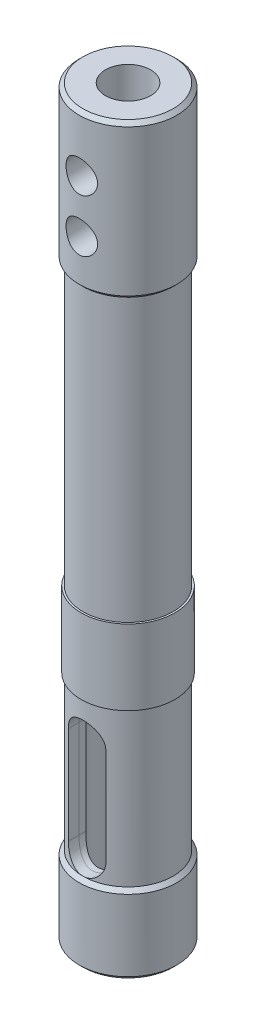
ISO-10303-21;
HEADER;
FILE_DESCRIPTION(('STEP AP214'),'2;1');
FILE_NAME('part.step','',(''),(''),'','','');
FILE_SCHEMA(('AUTOMOTIVE_DESIGN { 1 0 10303 214 1 1 1 1 }'));
ENDSEC;
DATA;
#1=APPLICATION_CONTEXT('core data for automotive mechanical design processes');
#2=APPLICATION_PROTOCOL_DEFINITION('international standard','automotive_design',2000,#1);
#3=PRODUCT_CONTEXT('',#1,'mechanical');
#4=PRODUCT('Part','Part','',(#3));
#5=PRODUCT_RELATED_PRODUCT_CATEGORY('part','',(#4));
#6=PRODUCT_DEFINITION_FORMATION('','',#4);
#7=PRODUCT_DEFINITION_CONTEXT('part definition',#1,'design');
#8=PRODUCT_DEFINITION('design','',#6,#7);
#9=PRODUCT_DEFINITION_SHAPE('','',#8);
#10=(LENGTH_UNIT() NAMED_UNIT(*) SI_UNIT(.MILLI.,.METRE.));
#11=(NAMED_UNIT(*) PLANE_ANGLE_UNIT() SI_UNIT($,.RADIAN.));
#12=(NAMED_UNIT(*) SI_UNIT($,.STERADIAN.) SOLID_ANGLE_UNIT());
#13=UNCERTAINTY_MEASURE_WITH_UNIT(LENGTH_MEASURE(1.E-05),#10,'distance_accuracy_value','');
#14=(GEOMETRIC_REPRESENTATION_CONTEXT(3) GLOBAL_UNCERTAINTY_ASSIGNED_CONTEXT((#13)) GLOBAL_UNIT_ASSIGNED_CONTEXT((#10,
#11,#12)) REPRESENTATION_CONTEXT('',''));
#15=CARTESIAN_POINT('',(0.,0.,0.));
#16=DIRECTION('',(0.,0.,1.));
#17=DIRECTION('',(1.,0.,0.));
#18=AXIS2_PLACEMENT_3D('',#15,#16,#17);
#19=CARTESIAN_POINT('',(0.,75.,0.));
#20=DIRECTION('',(0.,-1.,0.));
#21=DIRECTION('',(0.,0.,-1.));
#22=AXIS2_PLACEMENT_3D('',#19,#20,#21);
#23=CYLINDRICAL_SURFACE('',#22,4.75);
#24=CARTESIAN_POINT('',(0.,0.,0.));
#25=DIRECTION('',(0.,-1.,0.));
#26=DIRECTION('',(0.,0.,-1.));
#27=AXIS2_PLACEMENT_3D('',#24,#25,#26);
#28=CIRCLE('',#27,4.75);
#29=CARTESIAN_POINT('',(0.,0.,-4.75));
#30=VERTEX_POINT('',#29);
#31=EDGE_CURVE('E169',#30,#30,#28,.T.);
#32=ORIENTED_EDGE('',*,*,#31,.F.);
#33=EDGE_LOOP('',(#32));
#34=FACE_BOUND('',#33,.T.);
#35=CARTESIAN_POINT('',(0.,75.,0.));
#36=DIRECTION('',(0.,-1.,0.));
#37=DIRECTION('',(0.,0.,-1.));
#38=AXIS2_PLACEMENT_3D('',#35,#36,#37);
#39=CIRCLE('',#38,4.75);
#40=CARTESIAN_POINT('',(0.,75.,-4.75));
#41=VERTEX_POINT('',#40);
#42=EDGE_CURVE('E172',#41,#41,#39,.T.);
#43=ORIENTED_EDGE('',*,*,#42,.T.);
#44=EDGE_LOOP('',(#43));
#45=FACE_BOUND('',#44,.T.);
#46=DIRECTION('',(0.,-1.,0.));
#47=VECTOR('',#46,1.);
#48=CARTESIAN_POINT('',(-2.50000000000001,75.,4.03887360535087));
#49=LINE('',#48,#47);
#50=CARTESIAN_POINT('',(-2.5,13.,4.03887360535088));
#51=VERTEX_POINT('',#50);
#52=CARTESIAN_POINT('',(-2.5,26.,4.03887360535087));
#53=VERTEX_POINT('',#52);
#54=EDGE_CURVE('E106',#51,#53,#49,.F.);
#55=ORIENTED_EDGE('',*,*,#54,.T.);
#56=CARTESIAN_POINT('',(-2.5,26.,4.03887360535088));
#57=CARTESIAN_POINT('',(-2.50001235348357,26.0649275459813,4.03885262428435));
#58=CARTESIAN_POINT('',(-2.49747109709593,26.1298433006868,4.04043869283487));
#59=CARTESIAN_POINT('',(-2.48737881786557,26.2590928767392,4.04666655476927));
#60=CARTESIAN_POINT('',(-2.47983127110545,26.3234270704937,4.05130622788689));
#61=CARTESIAN_POINT('',(-2.45988643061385,26.4506460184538,4.06344510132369));
#62=CARTESIAN_POINT('',(-2.44751988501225,26.5135373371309,4.07092616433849));
#63=CARTESIAN_POINT('',(-2.418107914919,26.6378384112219,4.08846511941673));
#64=CARTESIAN_POINT('',(-2.40106186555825,26.6992479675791,4.09852335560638));
#65=CARTESIAN_POINT('',(-2.34328129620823,26.8803606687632,4.13201192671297));
#66=CARTESIAN_POINT('',(-2.29583559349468,26.997376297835,4.15880074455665));
#67=CARTESIAN_POINT('',(-2.18467019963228,27.2218731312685,4.2182552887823));
#68=CARTESIAN_POINT('',(-2.12092241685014,27.329337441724,4.25093113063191));
#69=CARTESIAN_POINT('',(-1.97217049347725,27.5423722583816,4.32208702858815));
#70=CARTESIAN_POINT('',(-1.88575769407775,27.646875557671,4.36082464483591));
#71=CARTESIAN_POINT('',(-1.69706812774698,27.8407252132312,4.43766153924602));
#72=CARTESIAN_POINT('',(-1.59478672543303,27.9300671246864,4.475760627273));
#73=CARTESIAN_POINT('',(-1.3676623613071,28.0978357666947,4.55053264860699));
#74=CARTESIAN_POINT('',(-1.24168979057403,28.1748966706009,4.58687116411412));
#75=CARTESIAN_POINT('',(-0.976293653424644,28.3062359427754,4.65058246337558));
#76=CARTESIAN_POINT('',(-0.836879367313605,28.3605298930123,4.67796137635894));
#77=CARTESIAN_POINT('',(-0.559995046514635,28.4403946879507,4.71878638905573));
#78=CARTESIAN_POINT('',(-0.423210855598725,28.4678646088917,4.73314742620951));
#79=CARTESIAN_POINT('',(-0.146281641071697,28.4995973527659,4.74976765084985));
#80=CARTESIAN_POINT('',(-0.0061389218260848,28.5038756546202,4.7520349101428));
#81=CARTESIAN_POINT('',(0.259077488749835,28.4897398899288,4.7446062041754));
#82=CARTESIAN_POINT('',(0.384304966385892,28.4734672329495,4.73603906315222));
#83=CARTESIAN_POINT('',(0.629943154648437,28.4225822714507,4.70966370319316));
#84=CARTESIAN_POINT('',(0.750353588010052,28.3879689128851,4.69185495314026));
#85=CARTESIAN_POINT('',(0.984886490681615,28.3012681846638,4.6483240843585));
#86=CARTESIAN_POINT('',(1.09891200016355,28.2489686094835,4.62250619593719));
#87=CARTESIAN_POINT('',(1.31682074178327,28.1287288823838,4.56521579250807));
#88=CARTESIAN_POINT('',(1.42070039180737,28.0607832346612,4.5337412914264));
#89=CARTESIAN_POINT('',(1.62664653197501,27.9032846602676,4.46424662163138));
#90=CARTESIAN_POINT('',(1.72745607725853,27.8122376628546,4.4258863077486));
#91=CARTESIAN_POINT('',(1.91310693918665,27.6150500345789,4.34886730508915));
#92=CARTESIAN_POINT('',(1.99793114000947,27.5088934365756,4.31020834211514));
#93=CARTESIAN_POINT('',(2.15560167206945,27.2746786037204,4.23369045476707));
#94=CARTESIAN_POINT('',(2.22703460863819,27.1455659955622,4.19611915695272));
#95=CARTESIAN_POINT('',(2.34654142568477,26.8749296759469,4.13048891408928));
#96=CARTESIAN_POINT('',(2.3946769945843,26.7334399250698,4.10240490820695));
#97=CARTESIAN_POINT('',(2.45299023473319,26.492435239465,4.06768309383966));
#98=CARTESIAN_POINT('',(2.47053199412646,26.3952558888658,4.05698994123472));
#99=CARTESIAN_POINT('',(2.48816633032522,26.2479635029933,4.04618005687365));
#100=CARTESIAN_POINT('',(2.49259816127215,26.198532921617,4.04344824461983));
#101=CARTESIAN_POINT('',(2.49851719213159,26.0994058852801,4.0397916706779));
#102=CARTESIAN_POINT('',(2.50000298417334,26.0497093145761,4.03886777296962));
#103=CARTESIAN_POINT('',(2.5,26.,4.03887360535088));
#104=B_SPLINE_CURVE_WITH_KNOTS('',3,(#56,#57,#58,#59,#60,#61,#62,#63,#64,#65,#66,#67,#68,#69,
#70,#71,#72,#73,#74,#75,#76,#77,#78,#79,#80,#81,#82,#83,#84,#85,#86,#87,#88,#89,#90,#91,#92,#93,
#94,#95,#96,#97,#98,#99,#100,#101,#102,#103),.UNSPECIFIED.,.F.,.F.,(4,2,2,2,2,2,2,2,2,2,2,2,2,2,
2,2,2,2,2,2,2,2,2,4),(0.,0.194694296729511,0.389253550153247,0.582591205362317,0.77595469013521,
1.16138950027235,1.54749301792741,1.96882110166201,2.39027249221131,2.84410128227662,
3.29761895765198,3.71600824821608,4.13411825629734,4.51204437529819,4.88999221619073,
5.27264594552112,5.65543429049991,6.07712100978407,6.49925670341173,6.95369719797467,
7.40692771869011,7.70398873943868,7.8529903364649,8.00206312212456),.UNSPECIFIED.);
#105=CARTESIAN_POINT('',(2.5,26.,4.03887360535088));
#106=VERTEX_POINT('',#105);
#107=EDGE_CURVE('E100',#53,#106,#104,.T.);
#108=ORIENTED_EDGE('',*,*,#107,.T.);
#109=DIRECTION('',(0.,-1.,0.));
#110=VECTOR('',#109,1.);
#111=CARTESIAN_POINT('',(2.49999999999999,75.,4.03887360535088));
#112=LINE('',#111,#110);
#113=CARTESIAN_POINT('',(2.49999999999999,13.,4.03887360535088));
#114=VERTEX_POINT('',#113);
#115=EDGE_CURVE('E89',#106,#114,#112,.T.);
#116=ORIENTED_EDGE('',*,*,#115,.T.);
#117=CARTESIAN_POINT('',(2.5,13.,4.03887360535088));
#118=CARTESIAN_POINT('',(2.50001235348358,12.9350724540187,4.03885262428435));
#119=CARTESIAN_POINT('',(2.49747109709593,12.8701566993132,4.04043869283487));
#120=CARTESIAN_POINT('',(2.48737881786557,12.7409071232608,4.04666655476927));
#121=CARTESIAN_POINT('',(2.47983127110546,12.6765729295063,4.05130622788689));
#122=CARTESIAN_POINT('',(2.45988643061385,12.5493539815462,4.06344510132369));
#123=CARTESIAN_POINT('',(2.44751988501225,12.4864626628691,4.07092616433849));
#124=CARTESIAN_POINT('',(2.418107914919,12.3621615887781,4.08846511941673));
#125=CARTESIAN_POINT('',(2.40106186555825,12.3007520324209,4.09852335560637));
#126=CARTESIAN_POINT('',(2.34328129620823,12.1196393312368,4.13201192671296));
#127=CARTESIAN_POINT('',(2.29583559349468,12.0026237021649,4.15880074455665));
#128=CARTESIAN_POINT('',(2.18467019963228,11.7781268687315,4.2182552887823));
#129=CARTESIAN_POINT('',(2.12092241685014,11.670662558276,4.25093113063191));
#130=CARTESIAN_POINT('',(1.97217049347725,11.4576277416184,4.32208702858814));
#131=CARTESIAN_POINT('',(1.88575769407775,11.353124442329,4.36082464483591));
#132=CARTESIAN_POINT('',(1.69706812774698,11.1592747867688,4.43766153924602));
#133=CARTESIAN_POINT('',(1.59478672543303,11.0699328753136,4.475760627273));
#134=CARTESIAN_POINT('',(1.3676623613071,10.9021642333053,4.55053264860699));
#135=CARTESIAN_POINT('',(1.24168979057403,10.8251033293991,4.58687116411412));
#136=CARTESIAN_POINT('',(0.976293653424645,10.6937640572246,4.65058246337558));
#137=CARTESIAN_POINT('',(0.836879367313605,10.6394701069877,4.67796137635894));
#138=CARTESIAN_POINT('',(0.559995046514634,10.5596053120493,4.71878638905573));
#139=CARTESIAN_POINT('',(0.423210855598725,10.5321353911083,4.73314742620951));
#140=CARTESIAN_POINT('',(0.146281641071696,10.5004026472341,4.74976765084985));
#141=CARTESIAN_POINT('',(0.00613892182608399,10.4961243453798,4.7520349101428));
#142=CARTESIAN_POINT('',(-0.259077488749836,10.5102601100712,4.7446062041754));
#143=CARTESIAN_POINT('',(-0.384304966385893,10.5265327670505,4.73603906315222));
#144=CARTESIAN_POINT('',(-0.629943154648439,10.5774177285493,4.70966370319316));
#145=CARTESIAN_POINT('',(-0.750353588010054,10.6120310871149,4.69185495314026));
#146=CARTESIAN_POINT('',(-0.984886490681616,10.6987318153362,4.6483240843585));
#147=CARTESIAN_POINT('',(-1.09891200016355,10.7510313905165,4.62250619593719));
#148=CARTESIAN_POINT('',(-1.31682074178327,10.8712711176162,4.56521579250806));
#149=CARTESIAN_POINT('',(-1.42070039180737,10.9392167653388,4.5337412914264));
#150=CARTESIAN_POINT('',(-1.62664653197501,11.0967153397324,4.46424662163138));
#151=CARTESIAN_POINT('',(-1.72745607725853,11.1877623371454,4.4258863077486));
#152=CARTESIAN_POINT('',(-1.91310693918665,11.3849499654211,4.34886730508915));
#153=CARTESIAN_POINT('',(-1.99793114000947,11.4911065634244,4.31020834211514));
#154=CARTESIAN_POINT('',(-2.15560167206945,11.7253213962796,4.23369045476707));
#155=CARTESIAN_POINT('',(-2.22703460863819,11.8544340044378,4.19611915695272));
#156=CARTESIAN_POINT('',(-2.34654142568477,12.1250703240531,4.13048891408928));
#157=CARTESIAN_POINT('',(-2.3946769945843,12.2665600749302,4.10240490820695));
#158=CARTESIAN_POINT('',(-2.45299023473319,12.507564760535,4.06768309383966));
#159=CARTESIAN_POINT('',(-2.47053199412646,12.6047441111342,4.05698994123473));
#160=CARTESIAN_POINT('',(-2.48816633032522,12.7520364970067,4.04618005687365));
#161=CARTESIAN_POINT('',(-2.49259816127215,12.801467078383,4.04344824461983));
#162=CARTESIAN_POINT('',(-2.49851719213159,12.9005941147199,4.0397916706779));
#163=CARTESIAN_POINT('',(-2.50000298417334,12.9502906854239,4.03886777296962));
#164=CARTESIAN_POINT('',(-2.5,13.,4.03887360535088));
#165=B_SPLINE_CURVE_WITH_KNOTS('',3,(#117,#118,#119,#120,#121,#122,#123,#124,#125,#126,#127,
#128,#129,#130,#131,#132,#133,#134,#135,#136,#137,#138,#139,#140,#141,#142,#143,#144,#145,#146,
#147,#148,#149,#150,#151,#152,#153,#154,#155,#156,#157,#158,#159,#160,#161,#162,#163,#164),
.UNSPECIFIED.,.F.,.F.,(4,2,2,2,2,2,2,2,2,2,2,2,2,2,2,2,2,2,2,2,2,2,2,4),(0.,0.194694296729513,
0.389253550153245,0.582591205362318,0.775954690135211,1.16138950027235,1.54749301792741,
1.96882110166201,2.39027249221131,2.84410128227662,3.29761895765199,3.71600824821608,
4.13411825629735,4.51204437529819,4.88999221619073,5.27264594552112,5.65543429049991,
6.07712100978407,6.49925670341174,6.95369719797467,7.40692771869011,7.70398873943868,
7.8529903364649,8.00206312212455),.UNSPECIFIED.);
#166=EDGE_CURVE('E94',#114,#51,#165,.T.);
#167=ORIENTED_EDGE('',*,*,#166,.T.);
#168=EDGE_LOOP('',(#55,#108,#116,#167));
#169=FACE_BOUND('',#168,.T.);
#170=ADVANCED_FACE('F47',(#34,#45,#169),#23,.T.);
#171=CARTESIAN_POINT('',(0.,75.,0.));
#172=DIRECTION('',(0.,-1.,0.));
#173=DIRECTION('',(0.,0.,-1.));
#174=AXIS2_PLACEMENT_3D('',#171,#172,#173);
#175=CYLINDRICAL_SURFACE('',#174,4.);
#176=CARTESIAN_POINT('',(0.,0.,0.));
#177=DIRECTION('',(0.,-1.,0.));
#178=DIRECTION('',(0.,0.,-1.));
#179=AXIS2_PLACEMENT_3D('',#176,#177,#178);
#180=CIRCLE('',#179,4.);
#181=CARTESIAN_POINT('',(0.,0.,-4.));
#182=VERTEX_POINT('',#181);
#183=EDGE_CURVE('E107',#182,#182,#180,.T.);
#184=ORIENTED_EDGE('',*,*,#183,.T.);
#185=EDGE_LOOP('',(#184));
#186=FACE_BOUND('',#185,.T.);
#187=CARTESIAN_POINT('',(0.,75.,0.));
#188=DIRECTION('',(0.,-1.,0.));
#189=DIRECTION('',(0.,0.,-1.));
#190=AXIS2_PLACEMENT_3D('',#187,#188,#189);
#191=CIRCLE('',#190,4.);
#192=CARTESIAN_POINT('',(0.,75.,-4.));
#193=VERTEX_POINT('',#192);
#194=EDGE_CURVE('E110',#193,#193,#191,.T.);
#195=ORIENTED_EDGE('',*,*,#194,.F.);
#196=EDGE_LOOP('',(#195));
#197=FACE_BOUND('',#196,.T.);
#198=CARTESIAN_POINT('',(-2.5,26.,3.1224989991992));
#199=CARTESIAN_POINT('',(-2.50001477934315,26.062589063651,3.12246983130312));
#200=CARTESIAN_POINT('',(-2.49765019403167,26.1251606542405,3.12438008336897));
#201=CARTESIAN_POINT('',(-2.48828029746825,26.2496688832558,3.13185657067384));
#202=CARTESIAN_POINT('',(-2.48128007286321,26.3116061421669,3.13741879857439));
#203=CARTESIAN_POINT('',(-2.46283666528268,26.4338533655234,3.15191422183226));
#204=CARTESIAN_POINT('',(-2.45143249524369,26.4941727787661,3.16081779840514));
#205=CARTESIAN_POINT('',(-2.42437172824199,26.6133168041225,3.18162125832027));
#206=CARTESIAN_POINT('',(-2.40871415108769,26.6721410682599,3.19352183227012));
#207=CARTESIAN_POINT('',(-2.35582163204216,26.845349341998,3.23296077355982));
#208=CARTESIAN_POINT('',(-2.31257077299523,26.9570858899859,3.26431707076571));
#209=CARTESIAN_POINT('',(-2.21157736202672,27.1717832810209,3.33356771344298));
#210=CARTESIAN_POINT('',(-2.15379896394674,27.2747215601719,3.37147815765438));
#211=CARTESIAN_POINT('',(-2.01646035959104,27.4837519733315,3.45560279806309));
#212=CARTESIAN_POINT('',(-1.93502498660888,27.5884418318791,3.50225073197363));
#213=CARTESIAN_POINT('',(-1.75657774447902,27.7838080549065,3.59507758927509));
#214=CARTESIAN_POINT('',(-1.65955996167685,27.8744790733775,3.64125632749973));
#215=CARTESIAN_POINT('',(-1.43834403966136,28.0502163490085,3.73459351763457));
#216=CARTESIAN_POINT('',(-1.31227798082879,28.1332803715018,3.78119569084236));
#217=CARTESIAN_POINT('',(-1.11164559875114,28.2405395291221,3.84306919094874));
#218=CARTESIAN_POINT('',(-1.04282188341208,28.2734108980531,3.86236031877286));
#219=CARTESIAN_POINT('',(-0.901763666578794,28.3329528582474,3.89770328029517));
#220=CARTESIAN_POINT('',(-0.829531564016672,28.3596277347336,3.91375735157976));
#221=CARTESIAN_POINT('',(-0.68970035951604,28.4039837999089,3.94066757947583));
#222=CARTESIAN_POINT('',(-0.622372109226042,28.4223019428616,3.95188533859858));
#223=CARTESIAN_POINT('',(-0.485997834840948,28.453302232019,3.97096238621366));
#224=CARTESIAN_POINT('',(-0.416952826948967,28.4659876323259,3.97882361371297));
#225=CARTESIAN_POINT('',(-0.277765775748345,28.4855137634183,3.99095468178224));
#226=CARTESIAN_POINT('',(-0.207624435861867,28.4923580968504,3.99522673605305));
#227=CARTESIAN_POINT('',(-0.0669115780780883,28.5000992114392,4.0000612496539));
#228=CARTESIAN_POINT('',(0.00365988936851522,28.5009966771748,4.000624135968));
#229=CARTESIAN_POINT('',(0.19604502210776,28.4952746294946,3.99704479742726));
#230=CARTESIAN_POINT('',(0.317681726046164,28.482693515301,3.9891704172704));
#231=CARTESIAN_POINT('',(0.556636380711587,28.4402698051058,3.96290905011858));
#232=CARTESIAN_POINT('',(0.673954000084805,28.4104258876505,3.94452125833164));
#233=CARTESIAN_POINT('',(0.901775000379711,28.3347904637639,3.89876110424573));
#234=CARTESIAN_POINT('',(1.01225989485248,28.2889577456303,3.87136553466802));
#235=CARTESIAN_POINT('',(1.22404551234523,28.1830594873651,3.80971109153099));
#236=CARTESIAN_POINT('',(1.32534462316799,28.1229914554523,3.77545101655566));
#237=CARTESIAN_POINT('',(1.52940761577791,27.9819569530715,3.69787160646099));
#238=CARTESIAN_POINT('',(1.63078889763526,27.8993210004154,3.65395555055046));
#239=CARTESIAN_POINT('',(1.81916737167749,27.7197675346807,3.56392515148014));
#240=CARTESIAN_POINT('',(1.9061381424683,27.622824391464,3.5178069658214));
#241=CARTESIAN_POINT('',(2.07479570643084,27.4024798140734,3.4213791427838));
#242=CARTESIAN_POINT('',(2.15428352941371,27.2772754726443,3.37131587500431));
#243=CARTESIAN_POINT('',(2.29064190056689,27.0124055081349,3.2801980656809));
#244=CARTESIAN_POINT('',(2.3475977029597,26.8727969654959,3.23910983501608));
#245=CARTESIAN_POINT('',(2.40934510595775,26.6698627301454,3.19304444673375));
#246=CARTESIAN_POINT('',(2.42489694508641,26.6112184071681,3.18122026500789));
#247=CARTESIAN_POINT('',(2.45177269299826,26.4924542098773,3.160553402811));
#248=CARTESIAN_POINT('',(2.46309820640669,26.4323349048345,3.15170959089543));
#249=CARTESIAN_POINT('',(2.48141228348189,26.3105084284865,3.13731387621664));
#250=CARTESIAN_POINT('',(2.48836260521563,26.2487920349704,3.13179101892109));
#251=CARTESIAN_POINT('',(2.49766650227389,26.1247234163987,3.12436704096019));
#252=CARTESIAN_POINT('',(2.50001440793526,26.0623705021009,3.12247038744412));
#253=CARTESIAN_POINT('',(2.5,26.,3.1224989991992));
#254=B_SPLINE_CURVE_WITH_KNOTS('',3,(#198,#199,#200,#201,#202,#203,#204,#205,#206,#207,#208,
#209,#210,#211,#212,#213,#214,#215,#216,#217,#218,#219,#220,#221,#222,#223,#224,#225,#226,#227,
#228,#229,#230,#231,#232,#233,#234,#235,#236,#237,#238,#239,#240,#241,#242,#243,#244,#245,#246,
#247,#248,#249,#250,#251,#252,#253),.UNSPECIFIED.,.F.,.F.,(4,2,2,2,2,2,2,2,2,2,2,2,2,2,2,2,2,2,
2,2,2,2,2,2,2,2,2,4),(0.,0.187665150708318,0.375124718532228,0.560960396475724,
0.746838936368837,1.11673096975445,1.48754481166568,1.90769010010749,2.32799521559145,
2.79910450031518,3.03481110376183,3.27035421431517,3.48206152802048,3.6936463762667,
3.90510062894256,4.11653053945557,4.48220719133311,4.84791183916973,5.21456615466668,
5.581284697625,5.9935793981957,6.40662186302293,6.87398244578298,7.33955736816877,
7.52481080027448,7.70999382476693,7.89677377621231,8.08378367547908),.UNSPECIFIED.);
#255=CARTESIAN_POINT('',(-2.5,26.,3.12249899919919));
#256=VERTEX_POINT('',#255);
#257=CARTESIAN_POINT('',(2.49999999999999,26.,3.12249899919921));
#258=VERTEX_POINT('',#257);
#259=EDGE_CURVE('E12',#256,#258,#254,.T.);
#260=ORIENTED_EDGE('',*,*,#259,.F.);
#261=DIRECTION('',(0.,-1.,0.));
#262=VECTOR('',#261,1.);
#263=CARTESIAN_POINT('',(-2.50000000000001,75.,3.12249899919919));
#264=LINE('',#263,#262);
#265=CARTESIAN_POINT('',(-2.5,13.,3.1224989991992));
#266=VERTEX_POINT('',#265);
#267=EDGE_CURVE('E60',#266,#256,#264,.F.);
#268=ORIENTED_EDGE('',*,*,#267,.F.);
#269=CARTESIAN_POINT('',(2.5,13.,3.1224989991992));
#270=CARTESIAN_POINT('',(2.50001477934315,12.9374109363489,3.12246983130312));
#271=CARTESIAN_POINT('',(2.49765019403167,12.8748393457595,3.12438008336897));
#272=CARTESIAN_POINT('',(2.48828029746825,12.7503311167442,3.13185657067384));
#273=CARTESIAN_POINT('',(2.48128007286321,12.6883938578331,3.13741879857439));
#274=CARTESIAN_POINT('',(2.46283666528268,12.5661466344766,3.15191422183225));
#275=CARTESIAN_POINT('',(2.45143249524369,12.5058272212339,3.16081779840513));
#276=CARTESIAN_POINT('',(2.42437172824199,12.3866831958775,3.18162125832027));
#277=CARTESIAN_POINT('',(2.40871415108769,12.3278589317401,3.19352183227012));
#278=CARTESIAN_POINT('',(2.35582163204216,12.154650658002,3.23296077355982));
#279=CARTESIAN_POINT('',(2.31257077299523,12.0429141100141,3.26431707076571));
#280=CARTESIAN_POINT('',(2.21157736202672,11.8282167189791,3.33356771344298));
#281=CARTESIAN_POINT('',(2.15379896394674,11.7252784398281,3.37147815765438));
#282=CARTESIAN_POINT('',(2.01646035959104,11.5162480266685,3.45560279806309));
#283=CARTESIAN_POINT('',(1.93502498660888,11.4115581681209,3.50225073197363));
#284=CARTESIAN_POINT('',(1.75657774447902,11.2161919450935,3.59507758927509));
#285=CARTESIAN_POINT('',(1.65955996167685,11.1255209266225,3.64125632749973));
#286=CARTESIAN_POINT('',(1.43834403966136,10.9497836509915,3.73459351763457));
#287=CARTESIAN_POINT('',(1.31227798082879,10.8667196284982,3.78119569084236));
#288=CARTESIAN_POINT('',(1.11164559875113,10.7594604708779,3.84306919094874));
#289=CARTESIAN_POINT('',(1.04282188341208,10.7265891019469,3.86236031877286));
#290=CARTESIAN_POINT('',(0.90176366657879,10.6670471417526,3.89770328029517));
#291=CARTESIAN_POINT('',(0.829531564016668,10.6403722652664,3.91375735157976));
#292=CARTESIAN_POINT('',(0.689700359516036,10.5960162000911,3.94066757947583));
#293=CARTESIAN_POINT('',(0.622372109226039,10.5776980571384,3.95188533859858));
#294=CARTESIAN_POINT('',(0.485997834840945,10.546697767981,3.97096238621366));
#295=CARTESIAN_POINT('',(0.416952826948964,10.5340123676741,3.97882361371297));
#296=CARTESIAN_POINT('',(0.277765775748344,10.5144862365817,3.99095468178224));
#297=CARTESIAN_POINT('',(0.207624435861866,10.5076419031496,3.99522673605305));
#298=CARTESIAN_POINT('',(0.0669115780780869,10.4999007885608,4.0000612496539));
#299=CARTESIAN_POINT('',(-0.00365988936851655,10.4990033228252,4.000624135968));
#300=CARTESIAN_POINT('',(-0.196045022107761,10.5047253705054,3.99704479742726));
#301=CARTESIAN_POINT('',(-0.317681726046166,10.517306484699,3.9891704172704));
#302=CARTESIAN_POINT('',(-0.55663638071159,10.5597301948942,3.96290905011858));
#303=CARTESIAN_POINT('',(-0.673954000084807,10.5895741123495,3.94452125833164));
#304=CARTESIAN_POINT('',(-0.901775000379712,10.6652095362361,3.89876110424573));
#305=CARTESIAN_POINT('',(-1.01225989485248,10.7110422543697,3.87136553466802));
#306=CARTESIAN_POINT('',(-1.22404551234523,10.8169405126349,3.80971109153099));
#307=CARTESIAN_POINT('',(-1.32534462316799,10.8770085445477,3.77545101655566));
#308=CARTESIAN_POINT('',(-1.52940761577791,11.0180430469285,3.69787160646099));
#309=CARTESIAN_POINT('',(-1.63078889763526,11.1006789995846,3.65395555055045));
#310=CARTESIAN_POINT('',(-1.81916737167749,11.2802324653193,3.56392515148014));
#311=CARTESIAN_POINT('',(-1.9061381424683,11.377175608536,3.5178069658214));
#312=CARTESIAN_POINT('',(-2.07479570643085,11.5975201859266,3.4213791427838));
#313=CARTESIAN_POINT('',(-2.15428352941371,11.7227245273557,3.37131587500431));
#314=CARTESIAN_POINT('',(-2.29064190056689,11.9875944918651,3.2801980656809));
#315=CARTESIAN_POINT('',(-2.3475977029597,12.1272030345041,3.23910983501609));
#316=CARTESIAN_POINT('',(-2.40934510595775,12.3301372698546,3.19304444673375));
#317=CARTESIAN_POINT('',(-2.42489694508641,12.3887815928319,3.18122026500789));
#318=CARTESIAN_POINT('',(-2.45177269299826,12.5075457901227,3.160553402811));
#319=CARTESIAN_POINT('',(-2.46309820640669,12.5676650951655,3.15170959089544));
#320=CARTESIAN_POINT('',(-2.48141228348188,12.6894915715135,3.13731387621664));
#321=CARTESIAN_POINT('',(-2.48836260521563,12.7512079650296,3.1317910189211));
#322=CARTESIAN_POINT('',(-2.49766650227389,12.8752765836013,3.12436704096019));
#323=CARTESIAN_POINT('',(-2.50001440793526,12.9376294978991,3.12247038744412));
#324=CARTESIAN_POINT('',(-2.5,13.,3.1224989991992));
#325=B_SPLINE_CURVE_WITH_KNOTS('',3,(#269,#270,#271,#272,#273,#274,#275,#276,#277,#278,#279,
#280,#281,#282,#283,#284,#285,#286,#287,#288,#289,#290,#291,#292,#293,#294,#295,#296,#297,#298,
#299,#300,#301,#302,#303,#304,#305,#306,#307,#308,#309,#310,#311,#312,#313,#314,#315,#316,#317,
#318,#319,#320,#321,#322,#323,#324),.UNSPECIFIED.,.F.,.F.,(4,2,2,2,2,2,2,2,2,2,2,2,2,2,2,2,2,2,
2,2,2,2,2,2,2,2,2,4),(0.,0.18766515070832,0.375124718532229,0.560960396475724,0.746838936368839,
1.11673096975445,1.48754481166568,1.90769010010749,2.32799521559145,2.79910450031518,
3.03481110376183,3.27035421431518,3.48206152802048,3.69364637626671,3.90510062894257,
4.11653053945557,4.48220719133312,4.84791183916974,5.21456615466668,5.58128469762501,
5.9935793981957,6.40662186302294,6.87398244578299,7.33955736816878,7.52481080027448,
7.70999382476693,7.8967737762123,8.08378367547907),.UNSPECIFIED.);
#326=CARTESIAN_POINT('',(2.5,13.,3.12249899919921));
#327=VERTEX_POINT('',#326);
#328=EDGE_CURVE('E133',#327,#266,#325,.T.);
#329=ORIENTED_EDGE('',*,*,#328,.F.);
#330=DIRECTION('',(0.,-1.,0.));
#331=VECTOR('',#330,1.);
#332=CARTESIAN_POINT('',(2.49999999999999,75.,3.12249899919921));
#333=LINE('',#332,#331);
#334=EDGE_CURVE('E138',#258,#327,#333,.T.);
#335=ORIENTED_EDGE('',*,*,#334,.F.);
#336=EDGE_LOOP('',(#260,#268,#329,#335));
#337=FACE_BOUND('',#336,.T.);
#338=ADVANCED_FACE('F124',(#186,#197,#337),#175,.F.);
#339=CARTESIAN_POINT('',(0.,75.,0.));
#340=DIRECTION('',(0.,-1.,0.));
#341=DIRECTION('',(0.,0.,-1.));
#342=AXIS2_PLACEMENT_3D('',#339,#340,#341);
#343=PLANE('',#342);
#344=ORIENTED_EDGE('',*,*,#194,.T.);
#345=EDGE_LOOP('',(#344));
#346=FACE_BOUND('',#345,.T.);
#347=ORIENTED_EDGE('',*,*,#42,.F.);
#348=EDGE_LOOP('',(#347));
#349=FACE_BOUND('',#348,.T.);
#350=ADVANCED_FACE('F129',(#346,#349),#343,.F.);
#351=CARTESIAN_POINT('',(0.,0.,0.));
#352=DIRECTION('',(0.,-1.,0.));
#353=DIRECTION('',(0.,0.,-1.));
#354=AXIS2_PLACEMENT_3D('',#351,#352,#353);
#355=PLANE('',#354);
#356=ORIENTED_EDGE('',*,*,#183,.F.);
#357=EDGE_LOOP('',(#356));
#358=FACE_BOUND('',#357,.T.);
#359=ORIENTED_EDGE('',*,*,#31,.T.);
#360=EDGE_LOOP('',(#359));
#361=FACE_BOUND('',#360,.T.);
#362=ADVANCED_FACE('F122',(#358,#361),#355,.T.);
#363=CARTESIAN_POINT('',(0.,26.,6.5));
#364=DIRECTION('',(0.,0.,-1.));
#365=DIRECTION('',(-1.,0.,0.));
#366=AXIS2_PLACEMENT_3D('',#363,#364,#365);
#367=CYLINDRICAL_SURFACE('',#366,2.5);
#368=DIRECTION('',(0.,0.,-1.));
#369=VECTOR('',#368,1.);
#370=CARTESIAN_POINT('',(-2.5,26.,6.5));
#371=LINE('',#370,#369);
#372=EDGE_CURVE('E95',#53,#256,#371,.T.);
#373=ORIENTED_EDGE('',*,*,#372,.T.);
#374=ORIENTED_EDGE('',*,*,#259,.T.);
#375=DIRECTION('',(0.,0.,-1.));
#376=VECTOR('',#375,1.);
#377=CARTESIAN_POINT('',(2.5,26.,6.5));
#378=LINE('',#377,#376);
#379=EDGE_CURVE('E72',#106,#258,#378,.T.);
#380=ORIENTED_EDGE('',*,*,#379,.F.);
#381=ORIENTED_EDGE('',*,*,#107,.F.);
#382=EDGE_LOOP('',(#373,#374,#380,#381));
#383=FACE_BOUND('',#382,.T.);
#384=ADVANCED_FACE('F99',(#383),#367,.F.);
#385=CARTESIAN_POINT('',(-2.5,26.,6.5));
#386=DIRECTION('',(1.,0.,0.));
#387=DIRECTION('',(0.,1.,0.));
#388=AXIS2_PLACEMENT_3D('',#385,#386,#387);
#389=PLANE('',#388);
#390=DIRECTION('',(0.,0.,-1.));
#391=VECTOR('',#390,1.);
#392=CARTESIAN_POINT('',(-2.5,13.,6.5));
#393=LINE('',#392,#391);
#394=EDGE_CURVE('E151',#51,#266,#393,.T.);
#395=ORIENTED_EDGE('',*,*,#394,.T.);
#396=ORIENTED_EDGE('',*,*,#267,.T.);
#397=ORIENTED_EDGE('',*,*,#372,.F.);
#398=ORIENTED_EDGE('',*,*,#54,.F.);
#399=EDGE_LOOP('',(#395,#396,#397,#398));
#400=FACE_BOUND('',#399,.T.);
#401=ADVANCED_FACE('F121',(#400),#389,.T.);
#402=CARTESIAN_POINT('',(0.,13.,6.5));
#403=DIRECTION('',(0.,0.,-1.));
#404=DIRECTION('',(-1.,0.,0.));
#405=AXIS2_PLACEMENT_3D('',#402,#403,#404);
#406=CYLINDRICAL_SURFACE('',#405,2.5);
#407=DIRECTION('',(0.,0.,-1.));
#408=VECTOR('',#407,1.);
#409=CARTESIAN_POINT('',(2.5,13.,6.5));
#410=LINE('',#409,#408);
#411=EDGE_CURVE('E67',#114,#327,#410,.T.);
#412=ORIENTED_EDGE('',*,*,#411,.T.);
#413=ORIENTED_EDGE('',*,*,#328,.T.);
#414=ORIENTED_EDGE('',*,*,#394,.F.);
#415=ORIENTED_EDGE('',*,*,#166,.F.);
#416=EDGE_LOOP('',(#412,#413,#414,#415));
#417=FACE_BOUND('',#416,.T.);
#418=ADVANCED_FACE('F140',(#417),#406,.F.);
#419=CARTESIAN_POINT('',(2.5,26.,6.5));
#420=DIRECTION('',(-1.,0.,0.));
#421=DIRECTION('',(0.,-1.,0.));
#422=AXIS2_PLACEMENT_3D('',#419,#420,#421);
#423=PLANE('',#422);
#424=ORIENTED_EDGE('',*,*,#379,.T.);
#425=ORIENTED_EDGE('',*,*,#334,.T.);
#426=ORIENTED_EDGE('',*,*,#411,.F.);
#427=ORIENTED_EDGE('',*,*,#115,.F.);
#428=EDGE_LOOP('',(#424,#425,#426,#427));
#429=FACE_BOUND('',#428,.T.);
#430=ADVANCED_FACE('F90',(#429),#423,.T.);
#431=CLOSED_SHELL('',(#170,#338,#350,#362,#384,#401,#418,#430));
#432=MANIFOLD_SOLID_BREP('B2',#431);
#433=CARTESIAN_POINT('',(0.,0.,0.));
#434=DIRECTION('',(0.,-1.,0.));
#435=DIRECTION('',(0.,0.,-1.));
#436=AXIS2_PLACEMENT_3D('',#433,#434,#435);
#437=CYLINDRICAL_SURFACE('',#436,4.75);
#438=CARTESIAN_POINT('',(0.,0.,0.));
#439=DIRECTION('',(0.,-1.,0.));
#440=DIRECTION('',(0.,0.,-1.));
#441=AXIS2_PLACEMENT_3D('',#438,#439,#440);
#442=CIRCLE('',#441,4.75);
#443=CARTESIAN_POINT('',(0.,0.,-4.75));
#444=VERTEX_POINT('',#443);
#445=EDGE_CURVE('E371',#444,#444,#442,.T.);
#446=ORIENTED_EDGE('',*,*,#445,.T.);
#447=EDGE_LOOP('',(#446));
#448=FACE_BOUND('',#447,.T.);
#449=CARTESIAN_POINT('',(0.,75.,0.));
#450=DIRECTION('',(0.,-1.,0.));
#451=DIRECTION('',(0.,0.,-1.));
#452=AXIS2_PLACEMENT_3D('',#449,#450,#451);
#453=CIRCLE('',#452,4.75);
#454=CARTESIAN_POINT('',(0.,75.,-4.75));
#455=VERTEX_POINT('',#454);
#456=EDGE_CURVE('E425',#455,#455,#453,.T.);
#457=ORIENTED_EDGE('',*,*,#456,.F.);
#458=EDGE_LOOP('',(#457));
#459=FACE_BOUND('',#458,.T.);
#460=CARTESIAN_POINT('',(-2.5,26.,4.03887360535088));
#461=CARTESIAN_POINT('',(-2.50001235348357,26.0649275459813,4.03885262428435));
#462=CARTESIAN_POINT('',(-2.49747109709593,26.1298433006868,4.04043869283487));
#463=CARTESIAN_POINT('',(-2.48737881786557,26.2590928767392,4.04666655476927));
#464=CARTESIAN_POINT('',(-2.47983127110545,26.3234270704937,4.05130622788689));
#465=CARTESIAN_POINT('',(-2.45988643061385,26.4506460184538,4.06344510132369));
#466=CARTESIAN_POINT('',(-2.44751988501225,26.5135373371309,4.07092616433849));
#467=CARTESIAN_POINT('',(-2.418107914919,26.6378384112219,4.08846511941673));
#468=CARTESIAN_POINT('',(-2.40106186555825,26.6992479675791,4.09852335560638));
#469=CARTESIAN_POINT('',(-2.34328129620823,26.8803606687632,4.13201192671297));
#470=CARTESIAN_POINT('',(-2.29583559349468,26.997376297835,4.15880074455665));
#471=CARTESIAN_POINT('',(-2.18467019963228,27.2218731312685,4.2182552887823));
#472=CARTESIAN_POINT('',(-2.12092241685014,27.329337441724,4.25093113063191));
#473=CARTESIAN_POINT('',(-1.97217049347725,27.5423722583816,4.32208702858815));
#474=CARTESIAN_POINT('',(-1.88575769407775,27.646875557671,4.36082464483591));
#475=CARTESIAN_POINT('',(-1.69706812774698,27.8407252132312,4.43766153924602));
#476=CARTESIAN_POINT('',(-1.59478672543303,27.9300671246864,4.475760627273));
#477=CARTESIAN_POINT('',(-1.3676623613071,28.0978357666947,4.55053264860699));
#478=CARTESIAN_POINT('',(-1.24168979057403,28.1748966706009,4.58687116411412));
#479=CARTESIAN_POINT('',(-0.976293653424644,28.3062359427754,4.65058246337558));
#480=CARTESIAN_POINT('',(-0.836879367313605,28.3605298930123,4.67796137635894));
#481=CARTESIAN_POINT('',(-0.559995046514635,28.4403946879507,4.71878638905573));
#482=CARTESIAN_POINT('',(-0.423210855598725,28.4678646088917,4.73314742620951));
#483=CARTESIAN_POINT('',(-0.146281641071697,28.4995973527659,4.74976765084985));
#484=CARTESIAN_POINT('',(-0.0061389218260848,28.5038756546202,4.7520349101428));
#485=CARTESIAN_POINT('',(0.259077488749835,28.4897398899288,4.7446062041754));
#486=CARTESIAN_POINT('',(0.384304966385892,28.4734672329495,4.73603906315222));
#487=CARTESIAN_POINT('',(0.629943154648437,28.4225822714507,4.70966370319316));
#488=CARTESIAN_POINT('',(0.750353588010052,28.3879689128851,4.69185495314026));
#489=CARTESIAN_POINT('',(0.984886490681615,28.3012681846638,4.6483240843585));
#490=CARTESIAN_POINT('',(1.09891200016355,28.2489686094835,4.62250619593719));
#491=CARTESIAN_POINT('',(1.31682074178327,28.1287288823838,4.56521579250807));
#492=CARTESIAN_POINT('',(1.42070039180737,28.0607832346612,4.5337412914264));
#493=CARTESIAN_POINT('',(1.62664653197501,27.9032846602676,4.46424662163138));
#494=CARTESIAN_POINT('',(1.72745607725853,27.8122376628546,4.4258863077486));
#495=CARTESIAN_POINT('',(1.91310693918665,27.6150500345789,4.34886730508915));
#496=CARTESIAN_POINT('',(1.99793114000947,27.5088934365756,4.31020834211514));
#497=CARTESIAN_POINT('',(2.15560167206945,27.2746786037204,4.23369045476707));
#498=CARTESIAN_POINT('',(2.22703460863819,27.1455659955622,4.19611915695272));
#499=CARTESIAN_POINT('',(2.34654142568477,26.8749296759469,4.13048891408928));
#500=CARTESIAN_POINT('',(2.3946769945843,26.7334399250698,4.10240490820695));
#501=CARTESIAN_POINT('',(2.45299023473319,26.492435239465,4.06768309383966));
#502=CARTESIAN_POINT('',(2.47053199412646,26.3952558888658,4.05698994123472));
#503=CARTESIAN_POINT('',(2.48816633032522,26.2479635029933,4.04618005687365));
#504=CARTESIAN_POINT('',(2.49259816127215,26.198532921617,4.04344824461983));
#505=CARTESIAN_POINT('',(2.49851719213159,26.0994058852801,4.0397916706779));
#506=CARTESIAN_POINT('',(2.50000298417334,26.0497093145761,4.03886777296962));
#507=CARTESIAN_POINT('',(2.5,26.,4.03887360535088));
#508=B_SPLINE_CURVE_WITH_KNOTS('',3,(#460,#461,#462,#463,#464,#465,#466,#467,#468,#469,#470,
#471,#472,#473,#474,#475,#476,#477,#478,#479,#480,#481,#482,#483,#484,#485,#486,#487,#488,#489,
#490,#491,#492,#493,#494,#495,#496,#497,#498,#499,#500,#501,#502,#503,#504,#505,#506,#507),
.UNSPECIFIED.,.F.,.F.,(4,2,2,2,2,2,2,2,2,2,2,2,2,2,2,2,2,2,2,2,2,2,2,4),(0.,0.194694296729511,
0.389253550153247,0.582591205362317,0.77595469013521,1.16138950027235,1.54749301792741,
1.96882110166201,2.39027249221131,2.84410128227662,3.29761895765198,3.71600824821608,
4.13411825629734,4.51204437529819,4.88999221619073,5.27264594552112,5.65543429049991,
6.07712100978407,6.49925670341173,6.95369719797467,7.40692771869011,7.70398873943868,
7.8529903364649,8.00206312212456),.UNSPECIFIED.);
#509=CARTESIAN_POINT('',(-2.5,26.,4.03887360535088));
#510=VERTEX_POINT('',#509);
#511=CARTESIAN_POINT('',(2.5,26.,4.03887360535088));
#512=VERTEX_POINT('',#511);
#513=EDGE_CURVE('E336',#510,#512,#508,.T.);
#514=ORIENTED_EDGE('',*,*,#513,.F.);
#515=DIRECTION('',(0.,-1.,0.));
#516=VECTOR('',#515,1.);
#517=CARTESIAN_POINT('',(-2.5,0.,4.03887360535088));
#518=LINE('',#517,#516);
#519=CARTESIAN_POINT('',(-2.5,13.,4.03887360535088));
#520=VERTEX_POINT('',#519);
#521=EDGE_CURVE('E279',#520,#510,#518,.F.);
#522=ORIENTED_EDGE('',*,*,#521,.F.);
#523=CARTESIAN_POINT('',(2.5,13.,4.03887360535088));
#524=CARTESIAN_POINT('',(2.50001235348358,12.9350724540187,4.03885262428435));
#525=CARTESIAN_POINT('',(2.49747109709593,12.8701566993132,4.04043869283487));
#526=CARTESIAN_POINT('',(2.48737881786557,12.7409071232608,4.04666655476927));
#527=CARTESIAN_POINT('',(2.47983127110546,12.6765729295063,4.05130622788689));
#528=CARTESIAN_POINT('',(2.45988643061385,12.5493539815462,4.06344510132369));
#529=CARTESIAN_POINT('',(2.44751988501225,12.4864626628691,4.07092616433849));
#530=CARTESIAN_POINT('',(2.418107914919,12.3621615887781,4.08846511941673));
#531=CARTESIAN_POINT('',(2.40106186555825,12.3007520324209,4.09852335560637));
#532=CARTESIAN_POINT('',(2.34328129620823,12.1196393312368,4.13201192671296));
#533=CARTESIAN_POINT('',(2.29583559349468,12.0026237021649,4.15880074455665));
#534=CARTESIAN_POINT('',(2.18467019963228,11.7781268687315,4.2182552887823));
#535=CARTESIAN_POINT('',(2.12092241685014,11.670662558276,4.25093113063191));
#536=CARTESIAN_POINT('',(1.97217049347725,11.4576277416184,4.32208702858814));
#537=CARTESIAN_POINT('',(1.88575769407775,11.353124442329,4.36082464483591));
#538=CARTESIAN_POINT('',(1.69706812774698,11.1592747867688,4.43766153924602));
#539=CARTESIAN_POINT('',(1.59478672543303,11.0699328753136,4.475760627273));
#540=CARTESIAN_POINT('',(1.3676623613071,10.9021642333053,4.55053264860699));
#541=CARTESIAN_POINT('',(1.24168979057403,10.8251033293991,4.58687116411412));
#542=CARTESIAN_POINT('',(0.976293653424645,10.6937640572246,4.65058246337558));
#543=CARTESIAN_POINT('',(0.836879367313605,10.6394701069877,4.67796137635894));
#544=CARTESIAN_POINT('',(0.559995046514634,10.5596053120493,4.71878638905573));
#545=CARTESIAN_POINT('',(0.423210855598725,10.5321353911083,4.73314742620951));
#546=CARTESIAN_POINT('',(0.146281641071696,10.5004026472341,4.74976765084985));
#547=CARTESIAN_POINT('',(0.00613892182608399,10.4961243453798,4.7520349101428));
#548=CARTESIAN_POINT('',(-0.259077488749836,10.5102601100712,4.7446062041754));
#549=CARTESIAN_POINT('',(-0.384304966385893,10.5265327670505,4.73603906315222));
#550=CARTESIAN_POINT('',(-0.629943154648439,10.5774177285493,4.70966370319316));
#551=CARTESIAN_POINT('',(-0.750353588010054,10.6120310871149,4.69185495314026));
#552=CARTESIAN_POINT('',(-0.984886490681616,10.6987318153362,4.6483240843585));
#553=CARTESIAN_POINT('',(-1.09891200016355,10.7510313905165,4.62250619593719));
#554=CARTESIAN_POINT('',(-1.31682074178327,10.8712711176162,4.56521579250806));
#555=CARTESIAN_POINT('',(-1.42070039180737,10.9392167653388,4.5337412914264));
#556=CARTESIAN_POINT('',(-1.62664653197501,11.0967153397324,4.46424662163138));
#557=CARTESIAN_POINT('',(-1.72745607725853,11.1877623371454,4.4258863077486));
#558=CARTESIAN_POINT('',(-1.91310693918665,11.3849499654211,4.34886730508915));
#559=CARTESIAN_POINT('',(-1.99793114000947,11.4911065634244,4.31020834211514));
#560=CARTESIAN_POINT('',(-2.15560167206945,11.7253213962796,4.23369045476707));
#561=CARTESIAN_POINT('',(-2.22703460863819,11.8544340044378,4.19611915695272));
#562=CARTESIAN_POINT('',(-2.34654142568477,12.1250703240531,4.13048891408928));
#563=CARTESIAN_POINT('',(-2.3946769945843,12.2665600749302,4.10240490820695));
#564=CARTESIAN_POINT('',(-2.45299023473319,12.507564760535,4.06768309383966));
#565=CARTESIAN_POINT('',(-2.47053199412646,12.6047441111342,4.05698994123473));
#566=CARTESIAN_POINT('',(-2.48816633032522,12.7520364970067,4.04618005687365));
#567=CARTESIAN_POINT('',(-2.49259816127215,12.801467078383,4.04344824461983));
#568=CARTESIAN_POINT('',(-2.49851719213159,12.9005941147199,4.0397916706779));
#569=CARTESIAN_POINT('',(-2.50000298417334,12.9502906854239,4.03886777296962));
#570=CARTESIAN_POINT('',(-2.5,13.,4.03887360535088));
#571=B_SPLINE_CURVE_WITH_KNOTS('',3,(#523,#524,#525,#526,#527,#528,#529,#530,#531,#532,#533,
#534,#535,#536,#537,#538,#539,#540,#541,#542,#543,#544,#545,#546,#547,#548,#549,#550,#551,#552,
#553,#554,#555,#556,#557,#558,#559,#560,#561,#562,#563,#564,#565,#566,#567,#568,#569,#570),
.UNSPECIFIED.,.F.,.F.,(4,2,2,2,2,2,2,2,2,2,2,2,2,2,2,2,2,2,2,2,2,2,2,4),(0.,0.194694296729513,
0.389253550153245,0.582591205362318,0.775954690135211,1.16138950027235,1.54749301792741,
1.96882110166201,2.39027249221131,2.84410128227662,3.29761895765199,3.71600824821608,
4.13411825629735,4.51204437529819,4.88999221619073,5.27264594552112,5.65543429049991,
6.07712100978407,6.49925670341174,6.95369719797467,7.40692771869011,7.70398873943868,
7.8529903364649,8.00206312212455),.UNSPECIFIED.);
#572=CARTESIAN_POINT('',(2.5,13.,4.03887360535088));
#573=VERTEX_POINT('',#572);
#574=EDGE_CURVE('E280',#573,#520,#571,.T.);
#575=ORIENTED_EDGE('',*,*,#574,.F.);
#576=DIRECTION('',(0.,-1.,0.));
#577=VECTOR('',#576,1.);
#578=CARTESIAN_POINT('',(2.5,0.,4.03887360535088));
#579=LINE('',#578,#577);
#580=EDGE_CURVE('E274',#512,#573,#579,.T.);
#581=ORIENTED_EDGE('',*,*,#580,.F.);
#582=EDGE_LOOP('',(#514,#522,#575,#581));
#583=FACE_BOUND('',#582,.T.);
#584=ADVANCED_FACE('F233',(#448,#459,#583),#437,.F.);
#585=CARTESIAN_POINT('',(0.,0.,0.));
#586=DIRECTION('',(0.,-1.,0.));
#587=DIRECTION('',(0.,0.,-1.));
#588=AXIS2_PLACEMENT_3D('',#585,#586,#587);
#589=CYLINDRICAL_SURFACE('',#588,5.99999999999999);
#590=CARTESIAN_POINT('',(0.,31.,0.));
#591=DIRECTION('',(0.,-1.,0.));
#592=DIRECTION('',(0.,0.,-1.));
#593=AXIS2_PLACEMENT_3D('',#590,#591,#592);
#594=CIRCLE('',#593,5.99999999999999);
#595=CARTESIAN_POINT('',(0.,31.,-5.99999999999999));
#596=VERTEX_POINT('',#595);
#597=EDGE_CURVE('E449',#596,#596,#594,.T.);
#598=ORIENTED_EDGE('',*,*,#597,.T.);
#599=EDGE_LOOP('',(#598));
#600=FACE_BOUND('',#599,.T.);
#601=CARTESIAN_POINT('',(2.5,26.,5.45435605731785));
#602=CARTESIAN_POINT('',(2.50001024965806,26.066990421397,5.4543414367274));
#603=CARTESIAN_POINT('',(2.49730766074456,26.1339728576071,5.45558986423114));
#604=CARTESIAN_POINT('',(2.48655699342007,26.267391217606,5.46050344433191));
#605=CARTESIAN_POINT('',(2.47851112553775,26.3338273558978,5.46416759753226));
#606=CARTESIAN_POINT('',(2.45719882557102,26.4654018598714,5.47378318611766));
#607=CARTESIAN_POINT('',(2.44395446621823,26.5305445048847,5.47972494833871));
#608=CARTESIAN_POINT('',(2.41239773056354,26.6593476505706,5.49369035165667));
#609=CARTESIAN_POINT('',(2.39408500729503,26.7230080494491,5.50171413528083));
#610=CARTESIAN_POINT('',(2.33184505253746,26.9109704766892,5.52852216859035));
#611=CARTESIAN_POINT('',(2.28056973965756,27.0325349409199,5.55006534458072));
#612=CARTESIAN_POINT('',(2.16009667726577,27.265394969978,5.5980502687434));
#613=CARTESIAN_POINT('',(2.09088024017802,27.3766796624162,5.62449711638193));
#614=CARTESIAN_POINT('',(1.93194216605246,27.5926555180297,5.68111739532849));
#615=CARTESIAN_POINT('',(1.84129131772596,27.6966314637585,5.71141645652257));
#616=CARTESIAN_POINT('',(1.6440247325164,27.8884169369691,5.77129106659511));
#617=CARTESIAN_POINT('',(1.53740558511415,27.9762230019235,5.80086645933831));
#618=CARTESIAN_POINT('',(1.30552662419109,28.1368988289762,5.85751079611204));
#619=CARTESIAN_POINT('',(1.17965801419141,28.2089534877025,5.88441492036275));
#620=CARTESIAN_POINT('',(0.916263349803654,28.3305523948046,5.93113050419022));
#621=CARTESIAN_POINT('',(0.778742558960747,28.3801067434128,5.95094514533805));
#622=CARTESIAN_POINT('',(0.503538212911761,28.4526785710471,5.98035028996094));
#623=CARTESIAN_POINT('',(0.366235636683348,28.4769429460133,5.99041924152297));
#624=CARTESIAN_POINT('',(0.0891608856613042,28.502275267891,6.00093656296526));
#625=CARTESIAN_POINT('',(-0.0506103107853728,28.5033522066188,6.00138866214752));
#626=CARTESIAN_POINT('',(-0.319586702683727,28.4829313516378,5.99290254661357));
#627=CARTESIAN_POINT('',(-0.448917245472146,28.4628034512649,5.98453414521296));
#628=CARTESIAN_POINT('',(-0.702167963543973,28.4028930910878,5.96013005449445));
#629=CARTESIAN_POINT('',(-0.82608783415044,28.3631095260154,5.94409393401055));
#630=CARTESIAN_POINT('',(-1.06727556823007,28.2645442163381,5.90559715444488));
#631=CARTESIAN_POINT('',(-1.18441306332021,28.2054818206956,5.88304219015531));
#632=CARTESIAN_POINT('',(-1.40742238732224,28.0703092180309,5.83371457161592));
#633=CARTESIAN_POINT('',(-1.51329009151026,27.9941928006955,5.80694038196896));
#634=CARTESIAN_POINT('',(-1.71867537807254,27.8208409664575,5.74963576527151));
#635=CARTESIAN_POINT('',(-1.81722082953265,27.7224958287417,5.71897359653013));
#636=CARTESIAN_POINT('',(-1.99685313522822,27.5105893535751,5.658760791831));
#637=CARTESIAN_POINT('',(-2.07793113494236,27.3970203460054,5.62921072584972));
#638=CARTESIAN_POINT('',(-2.22284514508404,27.1531453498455,5.57361619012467));
#639=CARTESIAN_POINT('',(-2.28601504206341,27.0224071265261,5.54772171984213));
#640=CARTESIAN_POINT('',(-2.38897619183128,26.7508546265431,5.50417661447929));
#641=CARTESIAN_POINT('',(-2.4288105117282,26.6100594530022,5.48651080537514));
#642=CARTESIAN_POINT('',(-2.47065526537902,26.3898491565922,5.46773287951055));
#643=CARTESIAN_POINT('',(-2.48164099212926,26.3123689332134,5.46274303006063));
#644=CARTESIAN_POINT('',(-2.49631631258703,26.1566098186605,5.45604541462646));
#645=CARTESIAN_POINT('',(-2.50000851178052,26.0783312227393,5.45433647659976));
#646=CARTESIAN_POINT('',(-2.5,26.,5.45435605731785));
#647=B_SPLINE_CURVE_WITH_KNOTS('',3,(#601,#602,#603,#604,#605,#606,#607,#608,#609,#610,#611,
#612,#613,#614,#615,#616,#617,#618,#619,#620,#621,#622,#623,#624,#625,#626,#627,#628,#629,#630,
#631,#632,#633,#634,#635,#636,#637,#638,#639,#640,#641,#642,#643,#644,#645,#646),.UNSPECIFIED.,
.F.,.F.,(4,2,2,2,2,2,2,2,2,2,2,2,2,2,2,2,2,2,2,2,2,2,4),(0.,0.200891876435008,0.401700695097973,
0.601665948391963,0.801644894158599,1.20075599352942,1.6002844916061,2.02212344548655,
2.44405262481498,2.88432120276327,3.32439195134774,3.74155898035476,4.15856423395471,
4.55019084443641,4.94183947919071,5.33946474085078,5.73723503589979,6.16301556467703,
6.58901142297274,7.02923147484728,7.46863649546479,7.70350874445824,7.93829707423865),.UNSPECIFIED.);
#648=CARTESIAN_POINT('',(2.5,26.,5.45435605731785));
#649=VERTEX_POINT('',#648);
#650=CARTESIAN_POINT('',(-2.5,26.,5.45435605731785));
#651=VERTEX_POINT('',#650);
#652=EDGE_CURVE('E329',#649,#651,#647,.T.);
#653=ORIENTED_EDGE('',*,*,#652,.F.);
#654=DIRECTION('',(0.,-1.,0.));
#655=VECTOR('',#654,1.);
#656=CARTESIAN_POINT('',(2.5,0.,5.45435605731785));
#657=LINE('',#656,#655);
#658=CARTESIAN_POINT('',(2.5,13.,5.45435605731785));
#659=VERTEX_POINT('',#658);
#660=EDGE_CURVE('E370',#659,#649,#657,.F.);
#661=ORIENTED_EDGE('',*,*,#660,.F.);
#662=CARTESIAN_POINT('',(-2.5,13.,5.45435605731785));
#663=CARTESIAN_POINT('',(-2.50001024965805,12.933009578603,5.4543414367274));
#664=CARTESIAN_POINT('',(-2.49730766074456,12.8660271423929,5.45558986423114));
#665=CARTESIAN_POINT('',(-2.48655699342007,12.732608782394,5.46050344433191));
#666=CARTESIAN_POINT('',(-2.47851112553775,12.6661726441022,5.46416759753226));
#667=CARTESIAN_POINT('',(-2.45719882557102,12.5345981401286,5.47378318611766));
#668=CARTESIAN_POINT('',(-2.44395446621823,12.4694554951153,5.47972494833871));
#669=CARTESIAN_POINT('',(-2.41239773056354,12.3406523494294,5.49369035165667));
#670=CARTESIAN_POINT('',(-2.39408500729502,12.2769919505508,5.50171413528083));
#671=CARTESIAN_POINT('',(-2.33184505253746,12.0890295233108,5.52852216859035));
#672=CARTESIAN_POINT('',(-2.28056973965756,11.9674650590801,5.55006534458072));
#673=CARTESIAN_POINT('',(-2.16009667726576,11.734605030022,5.5980502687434));
#674=CARTESIAN_POINT('',(-2.09088024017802,11.6233203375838,5.62449711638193));
#675=CARTESIAN_POINT('',(-1.93194216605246,11.4073444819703,5.68111739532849));
#676=CARTESIAN_POINT('',(-1.84129131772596,11.3033685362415,5.71141645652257));
#677=CARTESIAN_POINT('',(-1.6440247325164,11.1115830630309,5.77129106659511));
#678=CARTESIAN_POINT('',(-1.53740558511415,11.0237769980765,5.80086645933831));
#679=CARTESIAN_POINT('',(-1.30552662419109,10.8631011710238,5.85751079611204));
#680=CARTESIAN_POINT('',(-1.17965801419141,10.7910465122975,5.88441492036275));
#681=CARTESIAN_POINT('',(-0.91626334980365,10.6694476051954,5.93113050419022));
#682=CARTESIAN_POINT('',(-0.778742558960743,10.6198932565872,5.95094514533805));
#683=CARTESIAN_POINT('',(-0.503538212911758,10.5473214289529,5.98035028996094));
#684=CARTESIAN_POINT('',(-0.366235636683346,10.5230570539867,5.99041924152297));
#685=CARTESIAN_POINT('',(-0.0891608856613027,10.497724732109,6.00093656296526));
#686=CARTESIAN_POINT('',(0.0506103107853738,10.4966477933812,6.00138866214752));
#687=CARTESIAN_POINT('',(0.319586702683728,10.5170686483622,5.99290254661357));
#688=CARTESIAN_POINT('',(0.448917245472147,10.5371965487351,5.98453414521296));
#689=CARTESIAN_POINT('',(0.702167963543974,10.5971069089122,5.96013005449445));
#690=CARTESIAN_POINT('',(0.826087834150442,10.6368904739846,5.94409393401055));
#691=CARTESIAN_POINT('',(1.06727556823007,10.7354557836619,5.90559715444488));
#692=CARTESIAN_POINT('',(1.18441306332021,10.7945181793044,5.8830421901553));
#693=CARTESIAN_POINT('',(1.40742238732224,10.9296907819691,5.83371457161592));
#694=CARTESIAN_POINT('',(1.51329009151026,11.0058071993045,5.80694038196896));
#695=CARTESIAN_POINT('',(1.71867537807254,11.1791590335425,5.74963576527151));
#696=CARTESIAN_POINT('',(1.81722082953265,11.2775041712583,5.71897359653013));
#697=CARTESIAN_POINT('',(1.99685313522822,11.4894106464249,5.658760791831));
#698=CARTESIAN_POINT('',(2.07793113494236,11.6029796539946,5.62921072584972));
#699=CARTESIAN_POINT('',(2.22284514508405,11.8468546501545,5.57361619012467));
#700=CARTESIAN_POINT('',(2.28601504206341,11.9775928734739,5.54772171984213));
#701=CARTESIAN_POINT('',(2.38897619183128,12.2491453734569,5.50417661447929));
#702=CARTESIAN_POINT('',(2.4288105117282,12.3899405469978,5.48651080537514));
#703=CARTESIAN_POINT('',(2.47065526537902,12.6101508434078,5.46773287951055));
#704=CARTESIAN_POINT('',(2.48164099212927,12.6876310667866,5.46274303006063));
#705=CARTESIAN_POINT('',(2.49631631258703,12.8433901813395,5.45604541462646));
#706=CARTESIAN_POINT('',(2.50000851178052,12.9216687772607,5.45433647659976));
#707=CARTESIAN_POINT('',(2.5,13.,5.45435605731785));
#708=B_SPLINE_CURVE_WITH_KNOTS('',3,(#662,#663,#664,#665,#666,#667,#668,#669,#670,#671,#672,
#673,#674,#675,#676,#677,#678,#679,#680,#681,#682,#683,#684,#685,#686,#687,#688,#689,#690,#691,
#692,#693,#694,#695,#696,#697,#698,#699,#700,#701,#702,#703,#704,#705,#706,#707),.UNSPECIFIED.,
.F.,.F.,(4,2,2,2,2,2,2,2,2,2,2,2,2,2,2,2,2,2,2,2,2,2,4),(0.,0.200891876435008,0.401700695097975,
0.601665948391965,0.801644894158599,1.20075599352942,1.6002844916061,2.02212344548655,
2.44405262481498,2.88432120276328,3.32439195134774,3.74155898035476,4.15856423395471,
4.55019084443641,4.94183947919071,5.33946474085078,5.73723503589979,6.16301556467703,
6.58901142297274,7.02923147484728,7.4686364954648,7.70350874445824,7.93829707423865),.UNSPECIFIED.);
#709=CARTESIAN_POINT('',(0.,10.5,6.));
#710=VERTEX_POINT('',#709);
#711=EDGE_CURVE('E287',#710,#659,#708,.T.);
#712=ORIENTED_EDGE('',*,*,#711,.F.);
#713=CARTESIAN_POINT('',(0.,10.5,0.));
#714=DIRECTION('',(0.,-1.,0.));
#715=DIRECTION('',(0.,0.,-1.));
#716=AXIS2_PLACEMENT_3D('',#713,#714,#715);
#717=CIRCLE('',#716,5.99999999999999);
#718=EDGE_CURVE('E452',#710,#710,#717,.T.);
#719=ORIENTED_EDGE('',*,*,#718,.F.);
#720=CARTESIAN_POINT('',(-2.5,13.,5.45435605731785));
#721=VERTEX_POINT('',#720);
#722=EDGE_CURVE('E292',#721,#710,#708,.T.);
#723=ORIENTED_EDGE('',*,*,#722,.F.);
#724=DIRECTION('',(0.,-1.,0.));
#725=VECTOR('',#724,1.);
#726=CARTESIAN_POINT('',(-2.5,0.,5.45435605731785));
#727=LINE('',#726,#725);
#728=EDGE_CURVE('E495',#651,#721,#727,.T.);
#729=ORIENTED_EDGE('',*,*,#728,.F.);
#730=EDGE_LOOP('',(#653,#661,#712,#719,#723,#729));
#731=FACE_BOUND('',#730,.T.);
#732=ADVANCED_FACE('F390',(#600,#731),#589,.T.);
#733=CARTESIAN_POINT('',(-6.5,0.,0.));
#734=DIRECTION('',(0.,1.,0.));
#735=DIRECTION('',(0.,0.,1.));
#736=AXIS2_PLACEMENT_3D('',#733,#734,#735);
#737=PLANE('',#736);
#738=CARTESIAN_POINT('',(0.,0.,0.));
#739=DIRECTION('',(0.,1.,0.));
#740=DIRECTION('',(0.,0.,1.));
#741=AXIS2_PLACEMENT_3D('',#738,#739,#740);
#742=CIRCLE('',#741,5.99999999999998);
#743=CARTESIAN_POINT('',(0.,0.,5.99999999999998));
#744=VERTEX_POINT('',#743);
#745=EDGE_CURVE('E493',#744,#744,#742,.F.);
#746=ORIENTED_EDGE('',*,*,#745,.T.);
#747=EDGE_LOOP('',(#746));
#748=FACE_BOUND('',#747,.T.);
#749=ORIENTED_EDGE('',*,*,#445,.F.);
#750=EDGE_LOOP('',(#749));
#751=FACE_BOUND('',#750,.T.);
#752=ADVANCED_FACE('F394',(#748,#751),#737,.F.);
#753=CARTESIAN_POINT('',(-4.75,75.,0.));
#754=DIRECTION('',(0.,1.,0.));
#755=DIRECTION('',(0.,0.,1.));
#756=AXIS2_PLACEMENT_3D('',#753,#754,#755);
#757=PLANE('',#756);
#758=CARTESIAN_POINT('',(0.,75.,0.));
#759=DIRECTION('',(0.,-1.,0.));
#760=DIRECTION('',(0.,0.,-1.));
#761=AXIS2_PLACEMENT_3D('',#758,#759,#760);
#762=CIRCLE('',#761,3.);
#763=CARTESIAN_POINT('',(0.,75.,-3.));
#764=VERTEX_POINT('',#763);
#765=EDGE_CURVE('E427',#764,#764,#762,.T.);
#766=ORIENTED_EDGE('',*,*,#765,.F.);
#767=EDGE_LOOP('',(#766));
#768=FACE_BOUND('',#767,.T.);
#769=ORIENTED_EDGE('',*,*,#456,.T.);
#770=EDGE_LOOP('',(#769));
#771=FACE_BOUND('',#770,.T.);
#772=ADVANCED_FACE('F465',(#768,#771),#757,.F.);
#773=CARTESIAN_POINT('',(0.,0.,0.));
#774=DIRECTION('',(0.,-1.,0.));
#775=DIRECTION('',(0.,0.,-1.));
#776=AXIS2_PLACEMENT_3D('',#773,#774,#775);
#777=CYLINDRICAL_SURFACE('',#776,3.);
#778=CARTESIAN_POINT('',(-2.09999999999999,91.5,2.14242852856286));
#779=CARTESIAN_POINT('',(-2.09999602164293,91.3991988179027,2.14243638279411));
#780=CARTESIAN_POINT('',(-2.09267425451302,91.2983754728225,2.14968361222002));
#781=CARTESIAN_POINT('',(-2.06408052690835,91.1004673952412,2.17713849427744));
#782=CARTESIAN_POINT('',(-2.04277754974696,91.0033914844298,2.19737496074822));
#783=CARTESIAN_POINT('',(-1.98804598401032,90.8165820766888,2.24699925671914));
#784=CARTESIAN_POINT('',(-1.95475351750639,90.7267794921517,2.27628384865));
#785=CARTESIAN_POINT('',(-1.87736165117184,90.5542401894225,2.34052168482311));
#786=CARTESIAN_POINT('',(-1.8332614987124,90.471503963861,2.37547532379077));
#787=CARTESIAN_POINT('',(-1.72654345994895,90.2995826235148,2.45442122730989));
#788=CARTESIAN_POINT('',(-1.66203515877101,90.21180552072,2.49892440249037));
#789=CARTESIAN_POINT('',(-1.52013414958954,90.0470635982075,2.587704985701));
#790=CARTESIAN_POINT('',(-1.44272557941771,89.9701123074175,2.63198204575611));
#791=CARTESIAN_POINT('',(-1.26173250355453,89.816441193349,2.72396309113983));
#792=CARTESIAN_POINT('',(-1.15593562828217,89.7418942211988,2.7710097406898));
#793=CARTESIAN_POINT('',(-0.929408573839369,89.6123767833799,2.85494261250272));
#794=CARTESIAN_POINT('',(-0.808708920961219,89.5573671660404,2.89184912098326));
#795=CARTESIAN_POINT('',(-0.589969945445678,89.4822063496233,2.94295124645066));
#796=CARTESIAN_POINT('',(-0.494574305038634,89.4566581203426,2.96058586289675));
#797=CARTESIAN_POINT('',(-0.299930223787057,89.4191737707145,2.98657838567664));
#798=CARTESIAN_POINT('',(-0.200684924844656,89.4072267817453,2.99494369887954));
#799=CARTESIAN_POINT('',(-0.000967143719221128,89.3976169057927,3.00166671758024));
#800=CARTESIAN_POINT('',(0.0995073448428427,89.3999817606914,3.00000498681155));
#801=CARTESIAN_POINT('',(0.29845004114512,89.4189143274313,2.98678296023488));
#802=CARTESIAN_POINT('',(0.396917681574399,89.4354859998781,2.97521990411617));
#803=CARTESIAN_POINT('',(0.586910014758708,89.48136721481,2.9435711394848));
#804=CARTESIAN_POINT('',(0.678541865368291,89.5103774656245,2.92368592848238));
#805=CARTESIAN_POINT('',(0.855439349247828,89.5797757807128,2.876909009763));
#806=CARTESIAN_POINT('',(0.94070372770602,89.6201660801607,2.85001592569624));
#807=CARTESIAN_POINT('',(1.11283793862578,89.7160821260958,2.78763084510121));
#808=CARTESIAN_POINT('',(1.19881384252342,89.7727978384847,2.75151250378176));
#809=CARTESIAN_POINT('',(1.36056195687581,89.8970977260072,2.67523565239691));
#810=CARTESIAN_POINT('',(1.43632301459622,89.9646936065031,2.63507280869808));
#811=CARTESIAN_POINT('',(1.58960261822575,90.1225579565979,2.54604490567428));
#812=CARTESIAN_POINT('',(1.6650186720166,90.2147195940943,2.4969066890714));
#813=CARTESIAN_POINT('',(1.79983510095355,90.4115094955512,2.4015408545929));
#814=CARTESIAN_POINT('',(1.85923961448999,90.5161345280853,2.35531248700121));
#815=CARTESIAN_POINT('',(1.94855264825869,90.7114331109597,2.28159802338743));
#816=CARTESIAN_POINT('',(1.98210609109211,90.7997254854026,2.25225087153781));
#817=CARTESIAN_POINT('',(2.03740031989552,90.9822563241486,2.20236114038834));
#818=CARTESIAN_POINT('',(2.05916319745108,91.0764832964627,2.18180211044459));
#819=CARTESIAN_POINT('',(2.08967380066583,91.2699480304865,2.15261274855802));
#820=CARTESIAN_POINT('',(2.09828747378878,91.3692268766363,2.14410534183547));
#821=CARTESIAN_POINT('',(2.10124630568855,91.5681948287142,2.1412086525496));
#822=CARTESIAN_POINT('',(2.09559666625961,91.6678837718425,2.14681422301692));
#823=CARTESIAN_POINT('',(2.07235487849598,91.8501488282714,2.16922512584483));
#824=CARTESIAN_POINT('',(2.05653171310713,91.9331776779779,2.18436555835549));
#825=CARTESIAN_POINT('',(2.01563399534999,92.0951542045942,2.22215988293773));
#826=CARTESIAN_POINT('',(1.99054968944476,92.1740974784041,2.24482169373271));
#827=CARTESIAN_POINT('',(1.91823476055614,92.36307558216,2.30728989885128));
#828=CARTESIAN_POINT('',(1.86613806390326,92.4702383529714,2.35014375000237));
#829=CARTESIAN_POINT('',(1.74591178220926,92.672912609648,2.4407951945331));
#830=CARTESIAN_POINT('',(1.6777508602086,92.7684007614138,2.48860234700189));
#831=CARTESIAN_POINT('',(1.52511012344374,92.9485250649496,2.58502403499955));
#832=CARTESIAN_POINT('',(1.44034661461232,93.0329224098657,2.63363678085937));
#833=CARTESIAN_POINT('',(1.25629615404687,93.1870337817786,2.7262249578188));
#834=CARTESIAN_POINT('',(1.15703086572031,93.2567693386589,2.77020714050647));
#835=CARTESIAN_POINT('',(0.962367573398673,93.3693222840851,2.8430343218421));
#836=CARTESIAN_POINT('',(0.868922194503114,93.4146662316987,2.87317642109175));
#837=CARTESIAN_POINT('',(0.674279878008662,93.4915502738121,2.92497219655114));
#838=CARTESIAN_POINT('',(0.573087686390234,93.5230987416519,2.94663102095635));
#839=CARTESIAN_POINT('',(0.364831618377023,93.5708367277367,2.97960788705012));
#840=CARTESIAN_POINT('',(0.257737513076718,93.5869375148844,2.99086617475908));
#841=CARTESIAN_POINT('',(0.0417666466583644,93.6023699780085,3.00165393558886));
#842=CARTESIAN_POINT('',(-0.0671094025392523,93.6017081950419,3.0011879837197));
#843=CARTESIAN_POINT('',(-0.272289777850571,93.5845686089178,2.98921365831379));
#844=CARTESIAN_POINT('',(-0.368792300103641,93.5696252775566,2.97877665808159));
#845=CARTESIAN_POINT('',(-0.557534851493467,93.5269486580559,2.94928525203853));
#846=CARTESIAN_POINT('',(-0.649774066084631,93.499212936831,2.93022920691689));
#847=CARTESIAN_POINT('',(-0.831156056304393,93.4310361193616,2.88413721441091));
#848=CARTESIAN_POINT('',(-0.920077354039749,93.3901841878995,2.85684523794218));
#849=CARTESIAN_POINT('',(-1.0898885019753,93.2976386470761,2.79647566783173));
#850=CARTESIAN_POINT('',(-1.17077679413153,93.2459429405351,2.76339695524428));
#851=CARTESIAN_POINT('',(-1.33572629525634,93.124170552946,2.68798939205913));
#852=CARTESIAN_POINT('',(-1.41830558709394,93.0524836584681,2.64502293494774));
#853=CARTESIAN_POINT('',(-1.57109978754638,92.8976783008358,2.55723192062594));
#854=CARTESIAN_POINT('',(-1.6412882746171,92.8145360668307,2.51240363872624));
#855=CARTESIAN_POINT('',(-1.77845654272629,92.6238335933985,2.41765564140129));
#856=CARTESIAN_POINT('',(-1.84319523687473,92.5144895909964,2.36804412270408));
#857=CARTESIAN_POINT('',(-1.9528530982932,92.2827353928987,2.27846176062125));
#858=CARTESIAN_POINT('',(-1.99783234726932,92.1603662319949,2.23846186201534));
#859=CARTESIAN_POINT('',(-2.05371335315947,91.9472816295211,2.18705372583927));
#860=CARTESIAN_POINT('',(-2.07096487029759,91.8594738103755,2.17056502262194));
#861=CARTESIAN_POINT('',(-2.09410004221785,91.6811132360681,2.14825822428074));
#862=CARTESIAN_POINT('',(-2.10000357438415,91.5905655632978,2.14242147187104));
#863=CARTESIAN_POINT('',(-2.09999999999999,91.5,2.14242852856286));
#864=B_SPLINE_CURVE_WITH_KNOTS('',3,(#778,#779,#780,#781,#782,#783,#784,#785,#786,#787,#788,
#789,#790,#791,#792,#793,#794,#795,#796,#797,#798,#799,#800,#801,#802,#803,#804,#805,#806,#807,
#808,#809,#810,#811,#812,#813,#814,#815,#816,#817,#818,#819,#820,#821,#822,#823,#824,#825,#826,
#827,#828,#829,#830,#831,#832,#833,#834,#835,#836,#837,#838,#839,#840,#841,#842,#843,#844,#845,
#846,#847,#848,#849,#850,#851,#852,#853,#854,#855,#856,#857,#858,#859,#860,#861,#862,#863),
.UNSPECIFIED.,.T.,.F.,(4,2,2,2,2,2,2,2,2,2,2,2,2,2,2,2,2,2,2,2,2,2,2,2,2,2,2,2,2,2,2,2,2,2,2,2,
2,2,2,2,2,2,4),(0.,0.30197322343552,0.604618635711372,0.903931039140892,1.20326429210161,
1.55501769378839,1.90720684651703,2.31804977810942,2.7280646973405,3.02773360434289,
3.32716288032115,3.62717275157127,3.92726628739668,4.22051205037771,4.51381545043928,
4.84003888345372,5.16661565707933,5.5515158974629,5.9363165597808,6.23199289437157,
6.52711329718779,6.82522273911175,7.12322347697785,7.37980613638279,7.63665979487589,
8.01451127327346,8.39310602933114,8.77884561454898,9.16401474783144,9.48714146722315,
9.81007178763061,10.134846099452,10.4594936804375,10.7527707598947,11.0461036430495,
11.3497065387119,11.6533682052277,12.0045164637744,12.3564046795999,12.7636402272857,
13.1696287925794,13.4414153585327,13.7127254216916),.UNSPECIFIED.);
#865=CARTESIAN_POINT('',(-2.09999999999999,91.5,2.14242852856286));
#866=VERTEX_POINT('',#865);
#867=EDGE_CURVE('E341',#866,#866,#864,.T.);
#868=ORIENTED_EDGE('',*,*,#867,.T.);
#869=EDGE_LOOP('',(#868));
#870=FACE_BOUND('',#869,.T.);
#871=CARTESIAN_POINT('',(-2.09999999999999,84.5,2.14242852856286));
#872=CARTESIAN_POINT('',(-2.09999602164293,84.3991988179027,2.14243638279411));
#873=CARTESIAN_POINT('',(-2.09267425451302,84.2983754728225,2.14968361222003));
#874=CARTESIAN_POINT('',(-2.06408052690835,84.1004673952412,2.17713849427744));
#875=CARTESIAN_POINT('',(-2.04277754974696,84.0033914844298,2.19737496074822));
#876=CARTESIAN_POINT('',(-1.98804598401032,83.8165820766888,2.24699925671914));
#877=CARTESIAN_POINT('',(-1.95475351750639,83.7267794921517,2.27628384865));
#878=CARTESIAN_POINT('',(-1.87736165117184,83.5542401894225,2.34052168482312));
#879=CARTESIAN_POINT('',(-1.8332614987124,83.471503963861,2.37547532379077));
#880=CARTESIAN_POINT('',(-1.72654345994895,83.2995826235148,2.45442122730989));
#881=CARTESIAN_POINT('',(-1.662035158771,83.21180552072,2.49892440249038));
#882=CARTESIAN_POINT('',(-1.52013414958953,83.0470635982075,2.587704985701));
#883=CARTESIAN_POINT('',(-1.4427255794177,82.9701123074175,2.63198204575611));
#884=CARTESIAN_POINT('',(-1.26173250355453,82.816441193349,2.72396309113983));
#885=CARTESIAN_POINT('',(-1.15593562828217,82.7418942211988,2.7710097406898));
#886=CARTESIAN_POINT('',(-0.929408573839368,82.6123767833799,2.85494261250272));
#887=CARTESIAN_POINT('',(-0.808708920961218,82.5573671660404,2.89184912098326));
#888=CARTESIAN_POINT('',(-0.589969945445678,82.4822063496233,2.94295124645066));
#889=CARTESIAN_POINT('',(-0.494574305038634,82.4566581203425,2.96058586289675));
#890=CARTESIAN_POINT('',(-0.299930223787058,82.4191737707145,2.98657838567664));
#891=CARTESIAN_POINT('',(-0.200684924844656,82.4072267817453,2.99494369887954));
#892=CARTESIAN_POINT('',(-0.00096714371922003,82.3976169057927,3.00166671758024));
#893=CARTESIAN_POINT('',(0.0995073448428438,82.3999817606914,3.00000498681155));
#894=CARTESIAN_POINT('',(0.298450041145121,82.4189143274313,2.98678296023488));
#895=CARTESIAN_POINT('',(0.3969176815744,82.4354859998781,2.97521990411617));
#896=CARTESIAN_POINT('',(0.586910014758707,82.48136721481,2.9435711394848));
#897=CARTESIAN_POINT('',(0.678541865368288,82.5103774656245,2.92368592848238));
#898=CARTESIAN_POINT('',(0.855439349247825,82.5797757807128,2.876909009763));
#899=CARTESIAN_POINT('',(0.940703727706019,82.6201660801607,2.85001592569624));
#900=CARTESIAN_POINT('',(1.11283793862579,82.7160821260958,2.78763084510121));
#901=CARTESIAN_POINT('',(1.19881384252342,82.7727978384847,2.75151250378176));
#902=CARTESIAN_POINT('',(1.36056195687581,82.8970977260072,2.67523565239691));
#903=CARTESIAN_POINT('',(1.43632301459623,82.964693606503,2.63507280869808));
#904=CARTESIAN_POINT('',(1.58960261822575,83.1225579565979,2.54604490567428));
#905=CARTESIAN_POINT('',(1.6650186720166,83.2147195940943,2.4969066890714));
#906=CARTESIAN_POINT('',(1.79983510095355,83.4115094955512,2.4015408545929));
#907=CARTESIAN_POINT('',(1.85923961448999,83.5161345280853,2.35531248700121));
#908=CARTESIAN_POINT('',(1.94855264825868,83.7114331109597,2.28159802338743));
#909=CARTESIAN_POINT('',(1.98210609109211,83.7997254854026,2.25225087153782));
#910=CARTESIAN_POINT('',(2.03740031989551,83.9822563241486,2.20236114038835));
#911=CARTESIAN_POINT('',(2.05916319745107,84.0764832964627,2.18180211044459));
#912=CARTESIAN_POINT('',(2.08967380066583,84.2699480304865,2.15261274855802));
#913=CARTESIAN_POINT('',(2.09828747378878,84.3692268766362,2.14410534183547));
#914=CARTESIAN_POINT('',(2.10124630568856,84.5681948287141,2.1412086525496));
#915=CARTESIAN_POINT('',(2.09559666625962,84.6678837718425,2.14681422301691));
#916=CARTESIAN_POINT('',(2.07235487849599,84.8501488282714,2.16922512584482));
#917=CARTESIAN_POINT('',(2.05653171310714,84.9331776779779,2.18436555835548));
#918=CARTESIAN_POINT('',(2.01563399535,85.0951542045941,2.22215988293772));
#919=CARTESIAN_POINT('',(1.99054968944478,85.174097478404,2.2448216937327));
#920=CARTESIAN_POINT('',(1.91823476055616,85.3630755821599,2.30728989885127));
#921=CARTESIAN_POINT('',(1.86613806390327,85.4702383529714,2.35014375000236));
#922=CARTESIAN_POINT('',(1.74591178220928,85.672912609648,2.44079519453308));
#923=CARTESIAN_POINT('',(1.67775086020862,85.7684007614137,2.48860234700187));
#924=CARTESIAN_POINT('',(1.52511012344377,85.9485250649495,2.58502403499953));
#925=CARTESIAN_POINT('',(1.44034661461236,86.0329224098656,2.63363678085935));
#926=CARTESIAN_POINT('',(1.25629615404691,86.1870337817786,2.72622495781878));
#927=CARTESIAN_POINT('',(1.15703086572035,86.2567693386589,2.77020714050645));
#928=CARTESIAN_POINT('',(0.962367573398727,86.3693222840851,2.84303432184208));
#929=CARTESIAN_POINT('',(0.868922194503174,86.4146662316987,2.87317642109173));
#930=CARTESIAN_POINT('',(0.674279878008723,86.491550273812,2.92497219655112));
#931=CARTESIAN_POINT('',(0.573087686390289,86.5230987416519,2.94663102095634));
#932=CARTESIAN_POINT('',(0.364831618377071,86.5708367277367,2.97960788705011));
#933=CARTESIAN_POINT('',(0.257737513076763,86.5869375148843,2.99086617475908));
#934=CARTESIAN_POINT('',(0.0417666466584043,86.6023699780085,3.00165393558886));
#935=CARTESIAN_POINT('',(-0.0671094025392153,86.6017081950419,3.00118798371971));
#936=CARTESIAN_POINT('',(-0.272289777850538,86.5845686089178,2.98921365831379));
#937=CARTESIAN_POINT('',(-0.368792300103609,86.5696252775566,2.9787766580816));
#938=CARTESIAN_POINT('',(-0.557534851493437,86.5269486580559,2.94928525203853));
#939=CARTESIAN_POINT('',(-0.649774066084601,86.499212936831,2.93022920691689));
#940=CARTESIAN_POINT('',(-0.831156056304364,86.4310361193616,2.88413721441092));
#941=CARTESIAN_POINT('',(-0.920077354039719,86.3901841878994,2.85684523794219));
#942=CARTESIAN_POINT('',(-1.08988850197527,86.2976386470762,2.79647566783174));
#943=CARTESIAN_POINT('',(-1.1707767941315,86.2459429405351,2.76339695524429));
#944=CARTESIAN_POINT('',(-1.33572629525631,86.1241705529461,2.68798939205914));
#945=CARTESIAN_POINT('',(-1.41830558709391,86.0524836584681,2.64502293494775));
#946=CARTESIAN_POINT('',(-1.57109978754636,85.8976783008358,2.55723192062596));
#947=CARTESIAN_POINT('',(-1.64128827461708,85.8145360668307,2.51240363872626));
#948=CARTESIAN_POINT('',(-1.77845654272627,85.6238335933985,2.41765564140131));
#949=CARTESIAN_POINT('',(-1.84319523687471,85.5144895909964,2.36804412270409));
#950=CARTESIAN_POINT('',(-1.95285309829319,85.2827353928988,2.27846176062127));
#951=CARTESIAN_POINT('',(-1.9978323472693,85.160366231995,2.23846186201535));
#952=CARTESIAN_POINT('',(-2.05371335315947,84.9472816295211,2.18705372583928));
#953=CARTESIAN_POINT('',(-2.07096487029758,84.8594738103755,2.17056502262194));
#954=CARTESIAN_POINT('',(-2.09410004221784,84.6811132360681,2.14825822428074));
#955=CARTESIAN_POINT('',(-2.10000357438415,84.5905655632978,2.14242147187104));
#956=CARTESIAN_POINT('',(-2.09999999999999,84.5,2.14242852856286));
#957=B_SPLINE_CURVE_WITH_KNOTS('',3,(#871,#872,#873,#874,#875,#876,#877,#878,#879,#880,#881,
#882,#883,#884,#885,#886,#887,#888,#889,#890,#891,#892,#893,#894,#895,#896,#897,#898,#899,#900,
#901,#902,#903,#904,#905,#906,#907,#908,#909,#910,#911,#912,#913,#914,#915,#916,#917,#918,#919,
#920,#921,#922,#923,#924,#925,#926,#927,#928,#929,#930,#931,#932,#933,#934,#935,#936,#937,#938,
#939,#940,#941,#942,#943,#944,#945,#946,#947,#948,#949,#950,#951,#952,#953,#954,#955,#956),
.UNSPECIFIED.,.T.,.F.,(4,2,2,2,2,2,2,2,2,2,2,2,2,2,2,2,2,2,2,2,2,2,2,2,2,2,2,2,2,2,2,2,2,2,2,2,
2,2,2,2,2,2,4),(0.,0.30197322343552,0.604618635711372,0.903931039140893,1.20326429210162,
1.55501769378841,1.90720684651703,2.31804977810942,2.7280646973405,3.02773360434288,
3.32716288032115,3.62717275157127,3.92726628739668,4.22051205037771,4.51381545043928,
4.84003888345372,5.16661565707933,5.5515158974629,5.9363165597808,6.23199289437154,
6.52711329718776,6.82522273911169,7.1232234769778,7.37980613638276,7.63665979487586,
8.01451127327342,8.39310602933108,8.77884561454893,9.16401474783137,9.48714146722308,
9.81007178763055,10.134846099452,10.4594936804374,10.7527707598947,11.0461036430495,
11.3497065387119,11.6533682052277,12.0045164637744,12.3564046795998,12.7636402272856,
13.1696287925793,13.4414153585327,13.7127254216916),.UNSPECIFIED.);
#958=CARTESIAN_POINT('',(-2.09999999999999,84.5,2.14242852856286));
#959=VERTEX_POINT('',#958);
#960=EDGE_CURVE('E348',#959,#959,#957,.T.);
#961=ORIENTED_EDGE('',*,*,#960,.T.);
#962=EDGE_LOOP('',(#961));
#963=FACE_BOUND('',#962,.T.);
#964=CARTESIAN_POINT('',(0.,99.,0.));
#965=DIRECTION('',(0.,-1.,0.));
#966=DIRECTION('',(0.,0.,-1.));
#967=AXIS2_PLACEMENT_3D('',#964,#965,#966);
#968=CIRCLE('',#967,3.);
#969=CARTESIAN_POINT('',(0.,99.,-3.));
#970=VERTEX_POINT('',#969);
#971=EDGE_CURVE('E429',#970,#970,#968,.T.);
#972=ORIENTED_EDGE('',*,*,#971,.F.);
#973=EDGE_LOOP('',(#972));
#974=FACE_BOUND('',#973,.T.);
#975=ORIENTED_EDGE('',*,*,#765,.T.);
#976=EDGE_LOOP('',(#975));
#977=FACE_BOUND('',#976,.T.);
#978=ADVANCED_FACE('F461',(#870,#963,#974,#977),#777,.F.);
#979=CARTESIAN_POINT('',(-3.,99.,0.));
#980=DIRECTION('',(0.,-1.,0.));
#981=DIRECTION('',(0.,0.,-1.));
#982=AXIS2_PLACEMENT_3D('',#979,#980,#981);
#983=PLANE('',#982);
#984=CARTESIAN_POINT('',(0.,99.,0.));
#985=DIRECTION('',(0.,-1.,0.));
#986=DIRECTION('',(0.,0.,-1.));
#987=AXIS2_PLACEMENT_3D('',#984,#985,#986);
#988=CIRCLE('',#987,6.00000000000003);
#989=CARTESIAN_POINT('',(0.,99.,-6.00000000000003));
#990=VERTEX_POINT('',#989);
#991=EDGE_CURVE('E45',#990,#990,#988,.F.);
#992=ORIENTED_EDGE('',*,*,#991,.T.);
#993=EDGE_LOOP('',(#992));
#994=FACE_BOUND('',#993,.T.);
#995=ORIENTED_EDGE('',*,*,#971,.T.);
#996=EDGE_LOOP('',(#995));
#997=FACE_BOUND('',#996,.T.);
#998=ADVANCED_FACE('F359',(#994,#997),#983,.F.);
#999=CARTESIAN_POINT('',(0.,0.,0.));
#1000=DIRECTION('',(0.,-1.,0.));
#1001=DIRECTION('',(0.,0.,-1.));
#1002=AXIS2_PLACEMENT_3D('',#999,#1000,#1001);
#1003=CYLINDRICAL_SURFACE('',#1002,6.5);
#1004=CARTESIAN_POINT('',(0.,98.5,0.));
#1005=DIRECTION('',(0.,-1.,0.));
#1006=DIRECTION('',(0.,0.,-1.));
#1007=AXIS2_PLACEMENT_3D('',#1004,#1005,#1006);
#1008=CIRCLE('',#1007,6.5);
#1009=CARTESIAN_POINT('',(0.,98.5,-6.5));
#1010=VERTEX_POINT('',#1009);
#1011=EDGE_CURVE('E241',#1010,#1010,#1008,.T.);
#1012=ORIENTED_EDGE('',*,*,#1011,.T.);
#1013=EDGE_LOOP('',(#1012));
#1014=FACE_BOUND('',#1013,.T.);
#1015=CARTESIAN_POINT('',(0.,89.4,6.5));
#1016=CARTESIAN_POINT('',(-0.114780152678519,89.400000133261,6.49999984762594));
#1017=CARTESIAN_POINT('',(-0.229562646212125,89.409441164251,6.49693136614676));
#1018=CARTESIAN_POINT('',(-0.455758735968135,89.4468485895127,6.48499201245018));
#1019=CARTESIAN_POINT('',(-0.567171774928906,89.4748180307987,6.47612018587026));
#1020=CARTESIAN_POINT('',(-0.783334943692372,89.5482319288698,6.45354073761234));
#1021=CARTESIAN_POINT('',(-0.888095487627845,89.5936482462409,6.43984090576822));
#1022=CARTESIAN_POINT('',(-1.08851351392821,89.7005432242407,6.40901183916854));
#1023=CARTESIAN_POINT('',(-1.18416937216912,89.7620247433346,6.39188199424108));
#1024=CARTESIAN_POINT('',(-1.36679767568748,89.9014233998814,6.35537555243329));
#1025=CARTESIAN_POINT('',(-1.45343019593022,89.9797723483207,6.33594753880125));
#1026=CARTESIAN_POINT('',(-1.61258241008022,90.1497631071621,6.29732467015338));
#1027=CARTESIAN_POINT('',(-1.68509924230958,90.2414076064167,6.27812986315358));
#1028=CARTESIAN_POINT('',(-1.81585313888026,90.4383894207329,6.24158803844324));
#1029=CARTESIAN_POINT('',(-1.87365695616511,90.5440271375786,6.22430408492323));
#1030=CARTESIAN_POINT('',(-1.97053521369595,90.7641730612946,6.19431848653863));
#1031=CARTESIAN_POINT('',(-2.00961497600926,90.8786787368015,6.18161553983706));
#1032=CARTESIAN_POINT('',(-2.06667622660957,91.1094591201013,6.16276983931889));
#1033=CARTESIAN_POINT('',(-2.08529153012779,91.2255606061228,6.15643057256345));
#1034=CARTESIAN_POINT('',(-2.10287625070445,91.4593986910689,6.15044761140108));
#1035=CARTESIAN_POINT('',(-2.10185130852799,91.5771348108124,6.15080199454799));
#1036=CARTESIAN_POINT('',(-2.08067854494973,91.8055768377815,6.15799345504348));
#1037=CARTESIAN_POINT('',(-2.06134700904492,91.9163686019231,6.16455379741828));
#1038=CARTESIAN_POINT('',(-2.00543737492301,92.1330430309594,6.18296679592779));
#1039=CARTESIAN_POINT('',(-1.96885732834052,92.2389251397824,6.1948200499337));
#1040=CARTESIAN_POINT('',(-1.87893383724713,92.44467403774,6.22268788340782));
#1041=CARTESIAN_POINT('',(-1.82534134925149,92.5444233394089,6.23876362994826));
#1042=CARTESIAN_POINT('',(-1.70308717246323,92.7337759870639,6.2732382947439));
#1043=CARTESIAN_POINT('',(-1.6344213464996,92.8233765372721,6.29163785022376));
#1044=CARTESIAN_POINT('',(-1.48000669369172,92.9944892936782,6.32978643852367));
#1045=CARTESIAN_POINT('',(-1.39358721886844,93.0753925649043,6.34955748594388));
#1046=CARTESIAN_POINT('',(-1.20816261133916,93.2217118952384,6.38743186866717));
#1047=CARTESIAN_POINT('',(-1.10915641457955,93.2871266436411,6.40553506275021));
#1048=CARTESIAN_POINT('',(-0.900136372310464,93.4010630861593,6.43824721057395));
#1049=CARTESIAN_POINT('',(-0.790033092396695,93.4494305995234,6.45282391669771));
#1050=CARTESIAN_POINT('',(-0.562670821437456,93.5267726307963,6.47660732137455));
#1051=CARTESIAN_POINT('',(-0.445414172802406,93.5557534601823,6.48581576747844));
#1052=CARTESIAN_POINT('',(-0.212235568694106,93.5924414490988,6.49753974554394));
#1053=CARTESIAN_POINT('',(-0.0964560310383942,93.6009721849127,6.50031423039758));
#1054=CARTESIAN_POINT('',(0.134897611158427,93.5988518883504,6.49962893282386));
#1055=CARTESIAN_POINT('',(0.250471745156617,93.5882038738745,6.49617013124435));
#1056=CARTESIAN_POINT('',(0.474897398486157,93.5486849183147,6.48357748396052));
#1057=CARTESIAN_POINT('',(0.583846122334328,93.5203117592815,6.47459876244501));
#1058=CARTESIAN_POINT('',(0.795399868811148,93.4467627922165,6.4520280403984));
#1059=CARTESIAN_POINT('',(0.898004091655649,93.4015848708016,6.43843545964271));
#1060=CARTESIAN_POINT('',(1.09685611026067,93.2944320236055,6.40759659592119));
#1061=CARTESIAN_POINT('',(1.19287645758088,93.2320598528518,6.39026632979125));
#1062=CARTESIAN_POINT('',(1.37335993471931,93.0927605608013,6.35392571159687));
#1063=CARTESIAN_POINT('',(1.45781971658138,93.0158292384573,6.33491487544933));
#1064=CARTESIAN_POINT('',(1.61651818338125,92.8457209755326,6.29633442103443));
#1065=CARTESIAN_POINT('',(1.69016938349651,92.7519922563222,6.27677542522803));
#1066=CARTESIAN_POINT('',(1.82076055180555,92.553082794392,6.24014795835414));
#1067=CARTESIAN_POINT('',(1.87770059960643,92.4479021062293,6.22307947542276));
#1068=CARTESIAN_POINT('',(1.97293988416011,92.2291691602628,6.19354517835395));
#1069=CARTESIAN_POINT('',(2.01129547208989,92.1156434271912,6.18106547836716));
#1070=CARTESIAN_POINT('',(2.06819042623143,91.8832533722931,6.16226449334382));
#1071=CARTESIAN_POINT('',(2.08673801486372,91.7643912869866,6.15594065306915));
#1072=CARTESIAN_POINT('',(2.10287398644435,91.5308786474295,6.15044597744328));
#1073=CARTESIAN_POINT('',(2.10143170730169,91.4163020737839,6.1509443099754));
#1074=CARTESIAN_POINT('',(2.07999175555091,91.1891122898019,6.15822697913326));
#1075=CARTESIAN_POINT('',(2.05999506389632,91.0764989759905,6.1650109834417));
#1076=CARTESIAN_POINT('',(2.0026819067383,90.8582971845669,6.18386170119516));
#1077=CARTESIAN_POINT('',(1.96566104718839,90.7526226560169,6.19583805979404));
#1078=CARTESIAN_POINT('',(1.87558632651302,90.5489019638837,6.22369569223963));
#1079=CARTESIAN_POINT('',(1.82252904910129,90.4508574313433,6.23957779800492));
#1080=CARTESIAN_POINT('',(1.69932067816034,90.2607816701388,6.27427773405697));
#1081=CARTESIAN_POINT('',(1.62855266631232,90.1691676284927,6.29318990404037));
#1082=CARTESIAN_POINT('',(1.47299576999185,89.9988017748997,6.33140503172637));
#1083=CARTESIAN_POINT('',(1.38820303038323,89.9200535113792,6.35070809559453));
#1084=CARTESIAN_POINT('',(1.20335860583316,89.7748254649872,6.3883585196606));
#1085=CARTESIAN_POINT('',(1.10286967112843,89.7088851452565,6.40664701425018));
#1086=CARTESIAN_POINT('',(0.891645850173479,89.5949130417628,6.43943829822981));
#1087=CARTESIAN_POINT('',(0.780914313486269,89.5468754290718,6.45394231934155));
#1088=CARTESIAN_POINT('',(0.559731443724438,89.472831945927,6.4767469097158));
#1089=CARTESIAN_POINT('',(0.449724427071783,89.4456029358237,6.48538779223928));
#1090=CARTESIAN_POINT('',(0.226478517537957,89.4091890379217,6.49701374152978));
#1091=CARTESIAN_POINT('',(0.113240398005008,89.3999998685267,6.50000015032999));
#1092=CARTESIAN_POINT('',(0.,89.4,6.5));
#1093=B_SPLINE_CURVE_WITH_KNOTS('',3,(#1015,#1016,#1017,#1018,#1019,#1020,#1021,#1022,#1023,
#1024,#1025,#1026,#1027,#1028,#1029,#1030,#1031,#1032,#1033,#1034,#1035,#1036,#1037,#1038,#1039,
#1040,#1041,#1042,#1043,#1044,#1045,#1046,#1047,#1048,#1049,#1050,#1051,#1052,#1053,#1054,#1055,
#1056,#1057,#1058,#1059,#1060,#1061,#1062,#1063,#1064,#1065,#1066,#1067,#1068,#1069,#1070,#1071,
#1072,#1073,#1074,#1075,#1076,#1077,#1078,#1079,#1080,#1081,#1082,#1083,#1084,#1085,#1086,#1087,
#1088,#1089,#1090,#1091,#1092),.UNSPECIFIED.,.T.,.F.,(4,2,2,2,2,2,2,2,2,2,2,2,2,2,2,2,2,2,2,2,2,
2,2,2,2,2,2,2,2,2,2,2,2,2,2,2,2,2,4),(0.,0.343923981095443,0.68790453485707,1.03133260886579,
1.3748218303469,1.72845644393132,2.08216267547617,2.44531833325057,2.80837070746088,
3.15983101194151,3.51119037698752,3.84758565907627,4.18401894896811,4.52562389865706,
4.86732272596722,5.22571361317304,5.58413481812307,5.94571918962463,6.30718578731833,
6.65383086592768,7.00042140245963,7.33769086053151,7.6750027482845,8.02087649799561,
8.36685020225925,8.72753837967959,9.08822483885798,9.44781068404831,9.80724720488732,
10.1493177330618,10.4913701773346,10.8276953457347,11.1640922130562,11.5144204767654,
11.8648451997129,12.2278019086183,12.5906403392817,12.9300312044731,13.2693415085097),.UNSPECIFIED.);
#1094=CARTESIAN_POINT('',(0.,89.4,6.5));
#1095=VERTEX_POINT('',#1094);
#1096=EDGE_CURVE('E342',#1095,#1095,#1093,.T.);
#1097=ORIENTED_EDGE('',*,*,#1096,.T.);
#1098=EDGE_LOOP('',(#1097));
#1099=FACE_BOUND('',#1098,.T.);
#1100=CARTESIAN_POINT('',(0.,82.4,6.5));
#1101=CARTESIAN_POINT('',(-0.11478015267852,82.400000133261,6.49999984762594));
#1102=CARTESIAN_POINT('',(-0.229562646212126,82.409441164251,6.49693136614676));
#1103=CARTESIAN_POINT('',(-0.455758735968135,82.4468485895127,6.48499201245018));
#1104=CARTESIAN_POINT('',(-0.567171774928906,82.4748180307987,6.47612018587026));
#1105=CARTESIAN_POINT('',(-0.783334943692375,82.5482319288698,6.45354073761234));
#1106=CARTESIAN_POINT('',(-0.888095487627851,82.5936482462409,6.43984090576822));
#1107=CARTESIAN_POINT('',(-1.08851351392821,82.7005432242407,6.40901183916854));
#1108=CARTESIAN_POINT('',(-1.18416937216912,82.7620247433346,6.39188199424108));
#1109=CARTESIAN_POINT('',(-1.36679767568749,82.9014233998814,6.35537555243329));
#1110=CARTESIAN_POINT('',(-1.45343019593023,82.9797723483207,6.33594753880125));
#1111=CARTESIAN_POINT('',(-1.61258241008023,83.1497631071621,6.29732467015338));
#1112=CARTESIAN_POINT('',(-1.68509924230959,83.2414076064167,6.27812986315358));
#1113=CARTESIAN_POINT('',(-1.81585313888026,83.4383894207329,6.24158803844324));
#1114=CARTESIAN_POINT('',(-1.87365695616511,83.5440271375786,6.22430408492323));
#1115=CARTESIAN_POINT('',(-1.97053521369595,83.7641730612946,6.19431848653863));
#1116=CARTESIAN_POINT('',(-2.00961497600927,83.8786787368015,6.18161553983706));
#1117=CARTESIAN_POINT('',(-2.06667622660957,84.1094591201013,6.16276983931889));
#1118=CARTESIAN_POINT('',(-2.08529153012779,84.2255606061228,6.15643057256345));
#1119=CARTESIAN_POINT('',(-2.10287625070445,84.4593986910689,6.15044761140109));
#1120=CARTESIAN_POINT('',(-2.10185130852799,84.5771348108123,6.15080199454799));
#1121=CARTESIAN_POINT('',(-2.08067854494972,84.8055768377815,6.15799345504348));
#1122=CARTESIAN_POINT('',(-2.06134700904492,84.9163686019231,6.16455379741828));
#1123=CARTESIAN_POINT('',(-2.00543737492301,85.1330430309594,6.1829667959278));
#1124=CARTESIAN_POINT('',(-1.96885732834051,85.2389251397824,6.1948200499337));
#1125=CARTESIAN_POINT('',(-1.87893383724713,85.44467403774,6.22268788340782));
#1126=CARTESIAN_POINT('',(-1.82534134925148,85.5444233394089,6.23876362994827));
#1127=CARTESIAN_POINT('',(-1.70308717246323,85.7337759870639,6.2732382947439));
#1128=CARTESIAN_POINT('',(-1.63442134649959,85.8233765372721,6.29163785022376));
#1129=CARTESIAN_POINT('',(-1.48000669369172,85.9944892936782,6.32978643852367));
#1130=CARTESIAN_POINT('',(-1.39358721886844,86.0753925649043,6.34955748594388));
#1131=CARTESIAN_POINT('',(-1.20816261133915,86.2217118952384,6.38743186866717));
#1132=CARTESIAN_POINT('',(-1.10915641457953,86.287126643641,6.40553506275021));
#1133=CARTESIAN_POINT('',(-0.900136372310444,86.4010630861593,6.43824721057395));
#1134=CARTESIAN_POINT('',(-0.790033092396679,86.4494305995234,6.45282391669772));
#1135=CARTESIAN_POINT('',(-0.562670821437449,86.5267726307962,6.47660732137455));
#1136=CARTESIAN_POINT('',(-0.445414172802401,86.5557534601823,6.48581576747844));
#1137=CARTESIAN_POINT('',(-0.212235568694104,86.5924414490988,6.49753974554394));
#1138=CARTESIAN_POINT('',(-0.0964560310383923,86.6009721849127,6.50031423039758));
#1139=CARTESIAN_POINT('',(0.134897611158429,86.5988518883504,6.49962893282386));
#1140=CARTESIAN_POINT('',(0.250471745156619,86.5882038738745,6.49617013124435));
#1141=CARTESIAN_POINT('',(0.474897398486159,86.5486849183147,6.48357748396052));
#1142=CARTESIAN_POINT('',(0.58384612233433,86.5203117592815,6.47459876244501));
#1143=CARTESIAN_POINT('',(0.795399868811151,86.4467627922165,6.4520280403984));
#1144=CARTESIAN_POINT('',(0.89800409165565,86.4015848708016,6.43843545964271));
#1145=CARTESIAN_POINT('',(1.09685611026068,86.2944320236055,6.40759659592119));
#1146=CARTESIAN_POINT('',(1.19287645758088,86.2320598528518,6.39026632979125));
#1147=CARTESIAN_POINT('',(1.37335993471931,86.0927605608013,6.35392571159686));
#1148=CARTESIAN_POINT('',(1.45781971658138,86.0158292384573,6.33491487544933));
#1149=CARTESIAN_POINT('',(1.61651818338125,85.8457209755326,6.29633442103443));
#1150=CARTESIAN_POINT('',(1.69016938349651,85.7519922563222,6.27677542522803));
#1151=CARTESIAN_POINT('',(1.82076055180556,85.553082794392,6.24014795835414));
#1152=CARTESIAN_POINT('',(1.87770059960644,85.4479021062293,6.22307947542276));
#1153=CARTESIAN_POINT('',(1.97293988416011,85.2291691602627,6.19354517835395));
#1154=CARTESIAN_POINT('',(2.0112954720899,85.1156434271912,6.18106547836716));
#1155=CARTESIAN_POINT('',(2.06819042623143,84.8832533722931,6.16226449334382));
#1156=CARTESIAN_POINT('',(2.08673801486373,84.7643912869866,6.15594065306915));
#1157=CARTESIAN_POINT('',(2.10287398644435,84.5308786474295,6.15044597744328));
#1158=CARTESIAN_POINT('',(2.10143170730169,84.4163020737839,6.1509443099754));
#1159=CARTESIAN_POINT('',(2.07999175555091,84.1891122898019,6.15822697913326));
#1160=CARTESIAN_POINT('',(2.05999506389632,84.0764989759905,6.1650109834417));
#1161=CARTESIAN_POINT('',(2.0026819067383,83.8582971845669,6.18386170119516));
#1162=CARTESIAN_POINT('',(1.96566104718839,83.7526226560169,6.19583805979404));
#1163=CARTESIAN_POINT('',(1.87558632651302,83.5489019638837,6.22369569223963));
#1164=CARTESIAN_POINT('',(1.82252904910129,83.4508574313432,6.23957779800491));
#1165=CARTESIAN_POINT('',(1.69932067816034,83.2607816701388,6.27427773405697));
#1166=CARTESIAN_POINT('',(1.62855266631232,83.1691676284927,6.29318990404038));
#1167=CARTESIAN_POINT('',(1.47299576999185,82.9988017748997,6.33140503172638));
#1168=CARTESIAN_POINT('',(1.38820303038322,82.9200535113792,6.35070809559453));
#1169=CARTESIAN_POINT('',(1.20335860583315,82.7748254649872,6.3883585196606));
#1170=CARTESIAN_POINT('',(1.10286967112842,82.7088851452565,6.40664701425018));
#1171=CARTESIAN_POINT('',(0.891645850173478,82.5949130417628,6.43943829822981));
#1172=CARTESIAN_POINT('',(0.780914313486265,82.5468754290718,6.45394231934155));
#1173=CARTESIAN_POINT('',(0.559731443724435,82.472831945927,6.4767469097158));
#1174=CARTESIAN_POINT('',(0.449724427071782,82.4456029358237,6.48538779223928));
#1175=CARTESIAN_POINT('',(0.226478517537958,82.4091890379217,6.49701374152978));
#1176=CARTESIAN_POINT('',(0.113240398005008,82.3999998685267,6.50000015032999));
#1177=CARTESIAN_POINT('',(0.,82.4,6.5));
#1178=B_SPLINE_CURVE_WITH_KNOTS('',3,(#1100,#1101,#1102,#1103,#1104,#1105,#1106,#1107,#1108,
#1109,#1110,#1111,#1112,#1113,#1114,#1115,#1116,#1117,#1118,#1119,#1120,#1121,#1122,#1123,#1124,
#1125,#1126,#1127,#1128,#1129,#1130,#1131,#1132,#1133,#1134,#1135,#1136,#1137,#1138,#1139,#1140,
#1141,#1142,#1143,#1144,#1145,#1146,#1147,#1148,#1149,#1150,#1151,#1152,#1153,#1154,#1155,#1156,
#1157,#1158,#1159,#1160,#1161,#1162,#1163,#1164,#1165,#1166,#1167,#1168,#1169,#1170,#1171,#1172,
#1173,#1174,#1175,#1176,#1177),.UNSPECIFIED.,.T.,.F.,(4,2,2,2,2,2,2,2,2,2,2,2,2,2,2,2,2,2,2,2,2,
2,2,2,2,2,2,2,2,2,2,2,2,2,2,2,2,2,4),(0.,0.343923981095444,0.68790453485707,1.03133260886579,
1.3748218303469,1.72845644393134,2.08216267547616,2.44531833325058,2.80837070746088,
3.1598310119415,3.51119037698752,3.84758565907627,4.18401894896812,4.52562389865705,
4.86732272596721,5.22571361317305,5.58413481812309,5.94571918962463,6.30718578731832,
6.65383086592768,7.00042140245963,7.33769086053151,7.6750027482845,8.02087649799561,
8.36685020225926,8.72753837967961,9.08822483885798,9.44781068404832,9.80724720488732,
10.1493177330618,10.4913701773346,10.8276953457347,11.1640922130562,11.5144204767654,
11.8648451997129,12.2278019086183,12.5906403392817,12.9300312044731,13.2693415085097),.UNSPECIFIED.);
#1179=CARTESIAN_POINT('',(0.,82.4,6.5));
#1180=VERTEX_POINT('',#1179);
#1181=EDGE_CURVE('E364',#1180,#1180,#1178,.T.);
#1182=ORIENTED_EDGE('',*,*,#1181,.T.);
#1183=EDGE_LOOP('',(#1182));
#1184=FACE_BOUND('',#1183,.T.);
#1185=CARTESIAN_POINT('',(0.,79.,0.));
#1186=DIRECTION('',(0.,-1.,0.));
#1187=DIRECTION('',(0.,0.,-1.));
#1188=AXIS2_PLACEMENT_3D('',#1185,#1186,#1187);
#1189=CIRCLE('',#1188,6.5);
#1190=CARTESIAN_POINT('',(0.,79.,-6.5));
#1191=VERTEX_POINT('',#1190);
#1192=EDGE_CURVE('E434',#1191,#1191,#1189,.T.);
#1193=ORIENTED_EDGE('',*,*,#1192,.F.);
#1194=EDGE_LOOP('',(#1193));
#1195=FACE_BOUND('',#1194,.T.);
#1196=ADVANCED_FACE('F353',(#1014,#1099,#1184,#1195),#1003,.T.);
#1197=CARTESIAN_POINT('',(0.,79.,0.));
#1198=DIRECTION('',(0.,1.,0.));
#1199=DIRECTION('',(0.,0.,1.));
#1200=AXIS2_PLACEMENT_3D('',#1197,#1198,#1199);
#1201=CONICAL_SURFACE('',#1200,6.5,0.785398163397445);
#1202=CARTESIAN_POINT('',(0.,78.5,0.));
#1203=DIRECTION('',(0.,-1.,0.));
#1204=DIRECTION('',(0.,0.,-1.));
#1205=AXIS2_PLACEMENT_3D('',#1202,#1203,#1204);
#1206=CIRCLE('',#1205,6.);
#1207=CARTESIAN_POINT('',(0.,78.5,-6.));
#1208=VERTEX_POINT('',#1207);
#1209=EDGE_CURVE('E437',#1208,#1208,#1206,.T.);
#1210=ORIENTED_EDGE('',*,*,#1209,.F.);
#1211=EDGE_LOOP('',(#1210));
#1212=FACE_BOUND('',#1211,.T.);
#1213=ORIENTED_EDGE('',*,*,#1192,.T.);
#1214=EDGE_LOOP('',(#1213));
#1215=FACE_BOUND('',#1214,.T.);
#1216=ADVANCED_FACE('F358',(#1212,#1215),#1201,.T.);
#1217=CARTESIAN_POINT('',(0.,0.,0.));
#1218=DIRECTION('',(0.,-1.,0.));
#1219=DIRECTION('',(0.,0.,-1.));
#1220=AXIS2_PLACEMENT_3D('',#1217,#1218,#1219);
#1221=CYLINDRICAL_SURFACE('',#1220,6.);
#1222=CARTESIAN_POINT('',(0.,41.,0.));
#1223=DIRECTION('',(0.,-1.,0.));
#1224=DIRECTION('',(0.,0.,-1.));
#1225=AXIS2_PLACEMENT_3D('',#1222,#1223,#1224);
#1226=CIRCLE('',#1225,6.);
#1227=CARTESIAN_POINT('',(0.,41.,-6.));
#1228=VERTEX_POINT('',#1227);
#1229=EDGE_CURVE('E440',#1228,#1228,#1226,.T.);
#1230=ORIENTED_EDGE('',*,*,#1229,.F.);
#1231=EDGE_LOOP('',(#1230));
#1232=FACE_BOUND('',#1231,.T.);
#1233=ORIENTED_EDGE('',*,*,#1209,.T.);
#1234=EDGE_LOOP('',(#1233));
#1235=FACE_BOUND('',#1234,.T.);
#1236=ADVANCED_FACE('F406',(#1232,#1235),#1221,.T.);
#1237=CARTESIAN_POINT('',(-6.,41.,0.));
#1238=DIRECTION('',(0.,-1.,0.));
#1239=DIRECTION('',(0.,0.,-1.));
#1240=AXIS2_PLACEMENT_3D('',#1237,#1238,#1239);
#1241=PLANE('',#1240);
#1242=CARTESIAN_POINT('',(0.,41.,0.));
#1243=DIRECTION('',(0.,-1.,0.));
#1244=DIRECTION('',(0.,0.,-1.));
#1245=AXIS2_PLACEMENT_3D('',#1242,#1243,#1244);
#1246=CIRCLE('',#1245,6.25);
#1247=CARTESIAN_POINT('',(0.,41.,-6.25));
#1248=VERTEX_POINT('',#1247);
#1249=EDGE_CURVE('E443',#1248,#1248,#1246,.T.);
#1250=ORIENTED_EDGE('',*,*,#1249,.F.);
#1251=EDGE_LOOP('',(#1250));
#1252=FACE_BOUND('',#1251,.T.);
#1253=ORIENTED_EDGE('',*,*,#1229,.T.);
#1254=EDGE_LOOP('',(#1253));
#1255=FACE_BOUND('',#1254,.T.);
#1256=ADVANCED_FACE('F403',(#1252,#1255),#1241,.F.);
#1257=CARTESIAN_POINT('',(0.,0.,0.));
#1258=DIRECTION('',(0.,-1.,0.));
#1259=DIRECTION('',(0.,0.,-1.));
#1260=AXIS2_PLACEMENT_3D('',#1257,#1258,#1259);
#1261=CYLINDRICAL_SURFACE('',#1260,6.25);
#1262=CARTESIAN_POINT('',(0.,31.,0.));
#1263=DIRECTION('',(0.,-1.,0.));
#1264=DIRECTION('',(0.,0.,-1.));
#1265=AXIS2_PLACEMENT_3D('',#1262,#1263,#1264);
#1266=CIRCLE('',#1265,6.25);
#1267=CARTESIAN_POINT('',(0.,31.,-6.25));
#1268=VERTEX_POINT('',#1267);
#1269=EDGE_CURVE('E446',#1268,#1268,#1266,.T.);
#1270=ORIENTED_EDGE('',*,*,#1269,.F.);
#1271=EDGE_LOOP('',(#1270));
#1272=FACE_BOUND('',#1271,.T.);
#1273=ORIENTED_EDGE('',*,*,#1249,.T.);
#1274=EDGE_LOOP('',(#1273));
#1275=FACE_BOUND('',#1274,.T.);
#1276=ADVANCED_FACE('F399',(#1272,#1275),#1261,.T.);
#1277=CARTESIAN_POINT('',(-6.25,31.,0.));
#1278=DIRECTION('',(0.,1.,0.));
#1279=DIRECTION('',(0.,0.,1.));
#1280=AXIS2_PLACEMENT_3D('',#1277,#1278,#1279);
#1281=PLANE('',#1280);
#1282=ORIENTED_EDGE('',*,*,#597,.F.);
#1283=EDGE_LOOP('',(#1282));
#1284=FACE_BOUND('',#1283,.T.);
#1285=ORIENTED_EDGE('',*,*,#1269,.T.);
#1286=EDGE_LOOP('',(#1285));
#1287=FACE_BOUND('',#1286,.T.);
#1288=ADVANCED_FACE('F388',(#1284,#1287),#1281,.F.);
#1289=CARTESIAN_POINT('',(0.,10.5,0.));
#1290=DIRECTION('',(0.,-1.,0.));
#1291=DIRECTION('',(0.,0.,-1.));
#1292=AXIS2_PLACEMENT_3D('',#1289,#1290,#1291);
#1293=CONICAL_SURFACE('',#1292,5.99999999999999,0.785398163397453);
#1294=CARTESIAN_POINT('',(0.,10.,0.));
#1295=DIRECTION('',(0.,-1.,0.));
#1296=DIRECTION('',(0.,0.,-1.));
#1297=AXIS2_PLACEMENT_3D('',#1294,#1295,#1296);
#1298=CIRCLE('',#1297,6.5);
#1299=CARTESIAN_POINT('',(0.,10.,-6.5));
#1300=VERTEX_POINT('',#1299);
#1301=EDGE_CURVE('E454',#1300,#1300,#1298,.T.);
#1302=ORIENTED_EDGE('',*,*,#1301,.F.);
#1303=EDGE_LOOP('',(#1302));
#1304=FACE_BOUND('',#1303,.T.);
#1305=ORIENTED_EDGE('',*,*,#718,.T.);
#1306=EDGE_LOOP('',(#1305));
#1307=FACE_BOUND('',#1306,.T.);
#1308=ADVANCED_FACE('F385',(#1304,#1307),#1293,.T.);
#1309=CARTESIAN_POINT('',(0.,0.,0.));
#1310=DIRECTION('',(0.,-1.,0.));
#1311=DIRECTION('',(0.,0.,-1.));
#1312=AXIS2_PLACEMENT_3D('',#1309,#1310,#1311);
#1313=CYLINDRICAL_SURFACE('',#1312,6.5);
#1314=CARTESIAN_POINT('',(0.,0.500000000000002,0.));
#1315=DIRECTION('',(0.,1.,0.));
#1316=DIRECTION('',(0.,0.,1.));
#1317=AXIS2_PLACEMENT_3D('',#1314,#1315,#1316);
#1318=CIRCLE('',#1317,6.5);
#1319=CARTESIAN_POINT('',(0.,0.500000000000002,6.5));
#1320=VERTEX_POINT('',#1319);
#1321=EDGE_CURVE('E491',#1320,#1320,#1318,.T.);
#1322=ORIENTED_EDGE('',*,*,#1321,.T.);
#1323=EDGE_LOOP('',(#1322));
#1324=FACE_BOUND('',#1323,.T.);
#1325=ORIENTED_EDGE('',*,*,#1301,.T.);
#1326=EDGE_LOOP('',(#1325));
#1327=FACE_BOUND('',#1326,.T.);
#1328=ADVANCED_FACE('F380',(#1324,#1327),#1313,.T.);
#1329=CARTESIAN_POINT('',(0.,84.5,0.));
#1330=DIRECTION('',(0.,0.,-1.));
#1331=DIRECTION('',(-1.,0.,0.));
#1332=AXIS2_PLACEMENT_3D('',#1329,#1330,#1331);
#1333=CYLINDRICAL_SURFACE('',#1332,2.09999999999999);
#1334=ORIENTED_EDGE('',*,*,#1181,.F.);
#1335=EDGE_LOOP('',(#1334));
#1336=FACE_BOUND('',#1335,.T.);
#1337=ORIENTED_EDGE('',*,*,#960,.F.);
#1338=EDGE_LOOP('',(#1337));
#1339=FACE_BOUND('',#1338,.T.);
#1340=ADVANCED_FACE('F376',(#1336,#1339),#1333,.F.);
#1341=CARTESIAN_POINT('',(0.,91.5,0.));
#1342=DIRECTION('',(0.,0.,-1.));
#1343=DIRECTION('',(-1.,0.,0.));
#1344=AXIS2_PLACEMENT_3D('',#1341,#1342,#1343);
#1345=CYLINDRICAL_SURFACE('',#1344,2.09999999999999);
#1346=ORIENTED_EDGE('',*,*,#867,.F.);
#1347=EDGE_LOOP('',(#1346));
#1348=FACE_BOUND('',#1347,.T.);
#1349=ORIENTED_EDGE('',*,*,#1096,.F.);
#1350=EDGE_LOOP('',(#1349));
#1351=FACE_BOUND('',#1350,.T.);
#1352=ADVANCED_FACE('F323',(#1348,#1351),#1345,.F.);
#1353=CARTESIAN_POINT('',(0.,26.,6.5));
#1354=DIRECTION('',(0.,0.,-1.));
#1355=DIRECTION('',(-1.,0.,0.));
#1356=AXIS2_PLACEMENT_3D('',#1353,#1354,#1355);
#1357=CYLINDRICAL_SURFACE('',#1356,2.5);
#1358=ORIENTED_EDGE('',*,*,#513,.T.);
#1359=DIRECTION('',(0.,0.,-1.));
#1360=VECTOR('',#1359,1.);
#1361=CARTESIAN_POINT('',(2.5,26.,6.5));
#1362=LINE('',#1361,#1360);
#1363=EDGE_CURVE('E248',#649,#512,#1362,.T.);
#1364=ORIENTED_EDGE('',*,*,#1363,.F.);
#1365=ORIENTED_EDGE('',*,*,#652,.T.);
#1366=DIRECTION('',(0.,0.,-1.));
#1367=VECTOR('',#1366,1.);
#1368=CARTESIAN_POINT('',(-2.5,26.,6.5));
#1369=LINE('',#1368,#1367);
#1370=EDGE_CURVE('E650',#651,#510,#1369,.T.);
#1371=ORIENTED_EDGE('',*,*,#1370,.T.);
#1372=EDGE_LOOP('',(#1358,#1364,#1365,#1371));
#1373=FACE_BOUND('',#1372,.T.);
#1374=ADVANCED_FACE('F318',(#1373),#1357,.F.);
#1375=CARTESIAN_POINT('',(-2.5,26.,6.5));
#1376=DIRECTION('',(1.,0.,0.));
#1377=DIRECTION('',(0.,1.,0.));
#1378=AXIS2_PLACEMENT_3D('',#1375,#1376,#1377);
#1379=PLANE('',#1378);
#1380=ORIENTED_EDGE('',*,*,#521,.T.);
#1381=ORIENTED_EDGE('',*,*,#1370,.F.);
#1382=ORIENTED_EDGE('',*,*,#728,.T.);
#1383=DIRECTION('',(0.,0.,-1.));
#1384=VECTOR('',#1383,1.);
#1385=CARTESIAN_POINT('',(-2.5,13.,6.5));
#1386=LINE('',#1385,#1384);
#1387=EDGE_CURVE('E289',#721,#520,#1386,.T.);
#1388=ORIENTED_EDGE('',*,*,#1387,.T.);
#1389=EDGE_LOOP('',(#1380,#1381,#1382,#1388));
#1390=FACE_BOUND('',#1389,.T.);
#1391=ADVANCED_FACE('F314',(#1390),#1379,.T.);
#1392=CARTESIAN_POINT('',(2.5,26.,6.5));
#1393=DIRECTION('',(-1.,0.,0.));
#1394=DIRECTION('',(0.,-1.,0.));
#1395=AXIS2_PLACEMENT_3D('',#1392,#1393,#1394);
#1396=PLANE('',#1395);
#1397=ORIENTED_EDGE('',*,*,#580,.T.);
#1398=DIRECTION('',(0.,0.,-1.));
#1399=VECTOR('',#1398,1.);
#1400=CARTESIAN_POINT('',(2.5,13.,6.5));
#1401=LINE('',#1400,#1399);
#1402=EDGE_CURVE('E253',#659,#573,#1401,.T.);
#1403=ORIENTED_EDGE('',*,*,#1402,.F.);
#1404=ORIENTED_EDGE('',*,*,#660,.T.);
#1405=ORIENTED_EDGE('',*,*,#1363,.T.);
#1406=EDGE_LOOP('',(#1397,#1403,#1404,#1405));
#1407=FACE_BOUND('',#1406,.T.);
#1408=ADVANCED_FACE('F275',(#1407),#1396,.T.);
#1409=CARTESIAN_POINT('',(0.,13.,6.5));
#1410=DIRECTION('',(0.,0.,-1.));
#1411=DIRECTION('',(-1.,0.,0.));
#1412=AXIS2_PLACEMENT_3D('',#1409,#1410,#1411);
#1413=CYLINDRICAL_SURFACE('',#1412,2.5);
#1414=ORIENTED_EDGE('',*,*,#574,.T.);
#1415=ORIENTED_EDGE('',*,*,#1387,.F.);
#1416=ORIENTED_EDGE('',*,*,#722,.T.);
#1417=ORIENTED_EDGE('',*,*,#711,.T.);
#1418=ORIENTED_EDGE('',*,*,#1402,.T.);
#1419=EDGE_LOOP('',(#1414,#1415,#1416,#1417,#1418));
#1420=FACE_BOUND('',#1419,.T.);
#1421=ADVANCED_FACE('F283',(#1420),#1413,.F.);
#1422=CARTESIAN_POINT('',(0.,0.,0.));
#1423=DIRECTION('',(0.,1.,0.));
#1424=DIRECTION('',(0.,0.,1.));
#1425=AXIS2_PLACEMENT_3D('',#1422,#1423,#1424);
#1426=CONICAL_SURFACE('',#1425,5.99999999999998,0.785398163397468);
#1427=ORIENTED_EDGE('',*,*,#1321,.F.);
#1428=EDGE_LOOP('',(#1427));
#1429=FACE_BOUND('',#1428,.T.);
#1430=ORIENTED_EDGE('',*,*,#745,.F.);
#1431=EDGE_LOOP('',(#1430));
#1432=FACE_BOUND('',#1431,.T.);
#1433=ADVANCED_FACE('F313',(#1429,#1432),#1426,.T.);
#1434=CARTESIAN_POINT('',(0.,98.5,0.));
#1435=DIRECTION('',(0.,-1.,0.));
#1436=DIRECTION('',(0.,0.,-1.));
#1437=AXIS2_PLACEMENT_3D('',#1434,#1435,#1436);
#1438=CONICAL_SURFACE('',#1437,6.5,0.785398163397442);
#1439=ORIENTED_EDGE('',*,*,#991,.F.);
#1440=EDGE_LOOP('',(#1439));
#1441=FACE_BOUND('',#1440,.T.);
#1442=ORIENTED_EDGE('',*,*,#1011,.F.);
#1443=EDGE_LOOP('',(#1442));
#1444=FACE_BOUND('',#1443,.T.);
#1445=ADVANCED_FACE('F235',(#1441,#1444),#1438,.T.);
#1446=CLOSED_SHELL('',(#584,#732,#752,#772,#978,#998,#1196,#1216,#1236,#1256,#1276,#1288,#1308,
#1328,#1340,#1352,#1374,#1391,#1408,#1421,#1433,#1445));
#1447=MANIFOLD_SOLID_BREP('B6',#1446);
#1448=ADVANCED_BREP_SHAPE_REPRESENTATION('',(#18,#432,#1447),#14);
#1449=SHAPE_DEFINITION_REPRESENTATION(#9,#1448);
ENDSEC;
END-ISO-10303-21;
